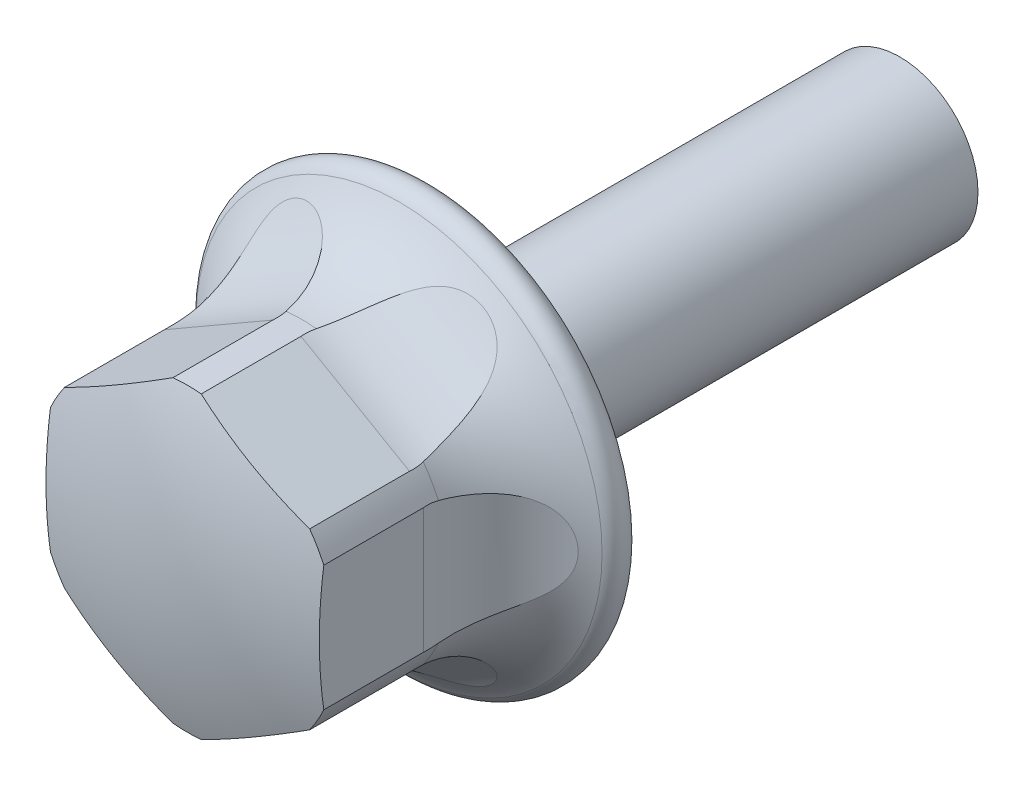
ISO-10303-21;
HEADER;
FILE_DESCRIPTION(('STEP AP214'),'2;1');
FILE_NAME('part.step','',(''),(''),'','','');
FILE_SCHEMA(('AUTOMOTIVE_DESIGN { 1 0 10303 214 1 1 1 1 }'));
ENDSEC;
DATA;
#1=APPLICATION_CONTEXT('core data for automotive mechanical design processes');
#2=APPLICATION_PROTOCOL_DEFINITION('international standard','automotive_design',2000,#1);
#3=PRODUCT_CONTEXT('',#1,'mechanical');
#4=PRODUCT('Part','Part','',(#3));
#5=PRODUCT_RELATED_PRODUCT_CATEGORY('part','',(#4));
#6=PRODUCT_DEFINITION_FORMATION('','',#4);
#7=PRODUCT_DEFINITION_CONTEXT('part definition',#1,'design');
#8=PRODUCT_DEFINITION('design','',#6,#7);
#9=PRODUCT_DEFINITION_SHAPE('','',#8);
#10=(LENGTH_UNIT() NAMED_UNIT(*) SI_UNIT(.MILLI.,.METRE.));
#11=(NAMED_UNIT(*) PLANE_ANGLE_UNIT() SI_UNIT($,.RADIAN.));
#12=(NAMED_UNIT(*) SI_UNIT($,.STERADIAN.) SOLID_ANGLE_UNIT());
#13=UNCERTAINTY_MEASURE_WITH_UNIT(LENGTH_MEASURE(1.E-05),#10,'distance_accuracy_value','');
#14=(GEOMETRIC_REPRESENTATION_CONTEXT(3) GLOBAL_UNCERTAINTY_ASSIGNED_CONTEXT((#13)) GLOBAL_UNIT_ASSIGNED_CONTEXT((#10,
#11,#12)) REPRESENTATION_CONTEXT('',''));
#15=CARTESIAN_POINT('',(0.,0.,0.));
#16=DIRECTION('',(0.,0.,1.));
#17=DIRECTION('',(1.,0.,0.));
#18=AXIS2_PLACEMENT_3D('',#15,#16,#17);
#19=CARTESIAN_POINT('',(0.,0.,0.));
#20=DIRECTION('',(0.,0.,1.));
#21=DIRECTION('',(1.,0.,0.));
#22=AXIS2_PLACEMENT_3D('',#19,#20,#21);
#23=CYLINDRICAL_SURFACE('',#22,3.85);
#24=DIRECTION('',(0.,0.,1.));
#25=VECTOR('',#24,1.);
#26=CARTESIAN_POINT('',(0.360980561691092,3.8330396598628,0.));
#27=LINE('',#26,#25);
#28=CARTESIAN_POINT('',(0.360980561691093,3.8330396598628,3.7));
#29=VERTEX_POINT('',#28);
#30=CARTESIAN_POINT('',(0.360980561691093,3.8330396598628,6.25454860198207));
#31=VERTEX_POINT('',#30);
#32=EDGE_CURVE('E285',#29,#31,#27,.T.);
#33=ORIENTED_EDGE('',*,*,#32,.F.);
#34=CARTESIAN_POINT('',(3.14133213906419,2.22587789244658,3.6));
#35=CARTESIAN_POINT('',(3.14132972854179,2.22588680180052,3.67209261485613));
#36=CARTESIAN_POINT('',(3.13772805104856,2.23099205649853,3.74427829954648));
#37=CARTESIAN_POINT('',(3.12329618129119,2.25114755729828,3.8866251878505));
#38=CARTESIAN_POINT('',(3.11244895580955,2.26622123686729,3.95678121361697));
#39=CARTESIAN_POINT('',(3.0835648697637,2.30536630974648,4.09278988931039));
#40=CARTESIAN_POINT('',(3.06554520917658,2.3294161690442,4.15865239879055));
#41=CARTESIAN_POINT('',(3.02242675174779,2.38509307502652,4.28453173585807));
#42=CARTESIAN_POINT('',(2.99733125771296,2.4167165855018,4.344551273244));
#43=CARTESIAN_POINT('',(2.93955899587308,2.48668377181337,4.45899291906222));
#44=CARTESIAN_POINT('',(2.90670406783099,2.52517918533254,4.51323167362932));
#45=CARTESIAN_POINT('',(2.834218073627,2.60627411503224,4.61347454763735));
#46=CARTESIAN_POINT('',(2.79458433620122,2.64887524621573,4.65947540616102));
#47=CARTESIAN_POINT('',(2.70521902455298,2.74020561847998,4.74668734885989));
#48=CARTESIAN_POINT('',(2.65489561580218,2.7891390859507,4.78707640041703));
#49=CARTESIAN_POINT('',(2.5477903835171,2.88730860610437,4.85760178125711));
#50=CARTESIAN_POINT('',(2.49100544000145,2.93654479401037,4.88773312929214));
#51=CARTESIAN_POINT('',(2.36485016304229,3.03930226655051,4.94098195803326));
#52=CARTESIAN_POINT('',(2.29478688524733,3.09263171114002,4.96282947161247));
#53=CARTESIAN_POINT('',(2.14930325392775,3.19545725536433,4.994345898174));
#54=CARTESIAN_POINT('',(2.07388008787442,3.2449513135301,5.0040083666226));
#55=CARTESIAN_POINT('',(1.91182641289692,3.34323636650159,5.01171324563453));
#56=CARTESIAN_POINT('',(1.82481601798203,3.39150087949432,5.00854732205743));
#57=CARTESIAN_POINT('',(1.64867265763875,3.48053494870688,4.98772705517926));
#58=CARTESIAN_POINT('',(1.55953898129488,3.52130195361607,4.97006779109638));
#59=CARTESIAN_POINT('',(1.3806473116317,3.59524964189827,4.9194149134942));
#60=CARTESIAN_POINT('',(1.29090203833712,3.62829894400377,4.88618119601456));
#61=CARTESIAN_POINT('',(1.11607614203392,3.68582821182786,4.80375685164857));
#62=CARTESIAN_POINT('',(1.03099276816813,3.71031327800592,4.75457575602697));
#63=CARTESIAN_POINT('',(0.876776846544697,3.74961025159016,4.64496546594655));
#64=CARTESIAN_POINT('',(0.806906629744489,3.76505601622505,4.58580750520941));
#65=CARTESIAN_POINT('',(0.678931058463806,3.7902259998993,4.45487866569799));
#66=CARTESIAN_POINT('',(0.620813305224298,3.79995626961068,4.38312123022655));
#67=CARTESIAN_POINT('',(0.526577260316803,3.81407903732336,4.23906105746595));
#68=CARTESIAN_POINT('',(0.488584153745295,3.81899981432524,4.16803379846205));
#69=CARTESIAN_POINT('',(0.426275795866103,3.82645839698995,4.02009144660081));
#70=CARTESIAN_POINT('',(0.401953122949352,3.8289974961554,3.94317957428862));
#71=CARTESIAN_POINT('',(0.369819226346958,3.83222761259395,3.79338854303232));
#72=CARTESIAN_POINT('',(0.36069113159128,3.83306758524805,3.72079246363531));
#73=CARTESIAN_POINT('',(0.355138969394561,3.83358665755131,3.57511986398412));
#74=CARTESIAN_POINT('',(0.358711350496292,3.83326608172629,3.50204348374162));
#75=CARTESIAN_POINT('',(0.378082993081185,3.83140185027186,3.35993726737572));
#76=CARTESIAN_POINT('',(0.393488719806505,3.82989752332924,3.29085270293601));
#77=CARTESIAN_POINT('',(0.43541385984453,3.82535691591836,3.15620987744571));
#78=CARTESIAN_POINT('',(0.461932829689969,3.82232069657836,3.09065147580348));
#79=CARTESIAN_POINT('',(0.525482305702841,3.8141059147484,2.9637516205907));
#80=CARTESIAN_POINT('',(0.562666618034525,3.80889545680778,2.90248951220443));
#81=CARTESIAN_POINT('',(0.645851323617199,3.79567451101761,2.78663451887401));
#82=CARTESIAN_POINT('',(0.691853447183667,3.78766347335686,2.73204294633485));
#83=CARTESIAN_POINT('',(0.793941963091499,3.76762742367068,2.62730956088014));
#84=CARTESIAN_POINT('',(0.850472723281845,3.75538709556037,2.57764331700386));
#85=CARTESIAN_POINT('',(0.969298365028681,3.72648654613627,2.48733296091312));
#86=CARTESIAN_POINT('',(1.03159558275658,3.70982452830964,2.44669252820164));
#87=CARTESIAN_POINT('',(1.16665056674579,3.66972569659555,2.37073273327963));
#88=CARTESIAN_POINT('',(1.23981909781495,3.64576027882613,2.33642416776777));
#89=CARTESIAN_POINT('',(1.38823431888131,3.59187298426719,2.27873434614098));
#90=CARTESIAN_POINT('',(1.46348205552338,3.56194805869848,2.25535870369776));
#91=CARTESIAN_POINT('',(1.62292979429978,3.49242319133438,2.21708076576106));
#92=CARTESIAN_POINT('',(1.70713440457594,3.45209709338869,2.2035101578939));
#93=CARTESIAN_POINT('',(1.87322046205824,3.36487137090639,2.18933908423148));
#94=CARTESIAN_POINT('',(1.95510068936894,3.31796836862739,2.18874530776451));
#95=CARTESIAN_POINT('',(2.1203235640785,3.21509841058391,2.20095385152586));
#96=CARTESIAN_POINT('',(2.2033417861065,3.15872083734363,2.21473059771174));
#97=CARTESIAN_POINT('',(2.36220399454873,3.04174621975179,2.25758442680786));
#98=CARTESIAN_POINT('',(2.43804730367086,2.9811487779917,2.28666295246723));
#99=CARTESIAN_POINT('',(2.57902416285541,2.85999818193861,2.3599068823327));
#100=CARTESIAN_POINT('',(2.64434850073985,2.79947059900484,2.40374408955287));
#101=CARTESIAN_POINT('',(2.76433887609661,2.68104952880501,2.50686671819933));
#102=CARTESIAN_POINT('',(2.81901589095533,2.62315337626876,2.56613608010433));
#103=CARTESIAN_POINT('',(2.9109311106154,2.52055788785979,2.69208328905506));
#104=CARTESIAN_POINT('',(2.94942597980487,2.47510744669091,2.75722909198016));
#105=CARTESIAN_POINT('',(3.01615970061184,2.39334071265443,2.89778338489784));
#106=CARTESIAN_POINT('',(3.0444018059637,2.35702152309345,2.97318860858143));
#107=CARTESIAN_POINT('',(3.08744702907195,2.30027918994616,3.12193102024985));
#108=CARTESIAN_POINT('',(3.10347518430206,2.27845103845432,3.19438350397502));
#109=CARTESIAN_POINT('',(3.12728289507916,2.24566806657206,3.3428671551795));
#110=CARTESIAN_POINT('',(3.13508644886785,2.23468161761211,3.41888723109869));
#111=CARTESIAN_POINT('',(3.14049004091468,2.22706492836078,3.53018309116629));
#112=CARTESIAN_POINT('',(3.14133330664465,2.2258735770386,3.56508062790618));
#113=CARTESIAN_POINT('',(3.14133213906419,2.22587789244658,3.6));
#114=B_SPLINE_CURVE_WITH_KNOTS('',3,(#34,#35,#36,#37,#38,#39,#40,#41,#42,#43,#44,#45,#46,#47,
#48,#49,#50,#51,#52,#53,#54,#55,#56,#57,#58,#59,#60,#61,#62,#63,#64,#65,#66,#67,#68,#69,#70,#71,
#72,#73,#74,#75,#76,#77,#78,#79,#80,#81,#82,#83,#84,#85,#86,#87,#88,#89,#90,#91,#92,#93,#94,#95,
#96,#97,#98,#99,#100,#101,#102,#103,#104,#105,#106,#107,#108,#109,#110,#111,#112,#113),
.UNSPECIFIED.,.T.,.F.,(4,2,2,2,2,2,2,2,2,2,2,2,2,2,2,2,2,2,2,2,2,2,2,2,2,2,2,2,2,2,2,2,2,2,2,2,
2,2,2,4),(0.,0.216172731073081,0.432855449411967,0.64902164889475,0.865087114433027,
1.08670191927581,1.3084042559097,1.55036947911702,1.79245203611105,2.06348945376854,
2.33467016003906,2.63195985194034,2.92935052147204,3.23148484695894,3.5334389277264,
3.81034897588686,4.08696534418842,4.32773862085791,4.56838105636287,4.78681066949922,
5.00517920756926,5.21658420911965,5.42798077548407,5.64259400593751,5.85724939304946,
6.08501804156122,6.3128793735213,6.56473225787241,6.81671431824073,7.09854455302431,
7.38052006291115,7.68294063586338,7.9853897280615,8.28151430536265,8.57733194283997,
8.84061034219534,9.10380511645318,9.33465462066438,9.56482865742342,9.66953586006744),.UNSPECIFIED.);
#115=CARTESIAN_POINT('',(0.38626604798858,3.83057417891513,3.33));
#116=VERTEX_POINT('',#115);
#117=EDGE_CURVE('E628',#29,#116,#114,.T.);
#118=ORIENTED_EDGE('',*,*,#117,.T.);
#119=CARTESIAN_POINT('',(0.,0.,3.33));
#120=DIRECTION('',(0.,0.,1.));
#121=DIRECTION('',(1.,0.,0.));
#122=AXIS2_PLACEMENT_3D('',#119,#120,#121);
#123=CIRCLE('',#122,3.85);
#124=CARTESIAN_POINT('',(-0.386266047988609,3.83057417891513,3.33));
#125=VERTEX_POINT('',#124);
#126=EDGE_CURVE('E267',#116,#125,#123,.T.);
#127=ORIENTED_EDGE('',*,*,#126,.T.);
#128=CARTESIAN_POINT('',(-0.357000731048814,3.83341238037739,3.6));
#129=CARTESIAN_POINT('',(-0.357009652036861,3.83341474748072,3.67209261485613));
#130=CARTESIAN_POINT('',(-0.36323177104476,3.83284823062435,3.74427829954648));
#131=CARTESIAN_POINT('',(-0.387902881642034,3.83042761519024,3.8866251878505));
#132=CARTESIAN_POINT('',(-0.406380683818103,3.82857048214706,3.95678121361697));
#133=CARTESIAN_POINT('',(-0.454723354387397,3.82312866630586,4.09278988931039));
#134=CARTESIAN_POINT('',(-0.484560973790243,3.8195481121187,4.15865239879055));
#135=CARTESIAN_POINT('',(-0.554337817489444,3.81004488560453,4.28453173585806));
#136=CARTESIAN_POINT('',(-0.594272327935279,3.80412330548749,4.34455127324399));
#137=CARTESIAN_POINT('',(-0.683751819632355,3.78907465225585,4.45899291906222));
#138=CARTESIAN_POINT('',(-0.733517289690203,3.77986915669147,4.51323167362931));
#139=CARTESIAN_POINT('',(-0.839990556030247,3.75764190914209,4.61347454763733));
#140=CARTESIAN_POINT('',(-0.896701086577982,3.74461865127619,4.65947540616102));
#141=CARTESIAN_POINT('',(-1.02047816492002,3.71289120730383,4.74668734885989));
#142=CARTESIAN_POINT('',(-1.08801749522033,3.69377659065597,4.78707640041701));
#143=CARTESIAN_POINT('',(-1.22658740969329,3.65010549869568,4.85760178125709));
#144=CARTESIAN_POINT('',(-1.29761967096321,3.62554638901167,4.88773312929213));
#145=CARTESIAN_POINT('',(-1.44968789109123,3.56767145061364,4.94098195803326));
#146=CARTESIAN_POINT('',(-1.53090418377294,3.53365959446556,4.96282947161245));
#147=CARTESIAN_POINT('',(-1.69269553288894,3.45907984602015,4.99434589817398));
#148=CARTESIAN_POINT('',(-1.77327022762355,3.41850849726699,5.0040083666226));
#149=CARTESIAN_POINT('',(-1.9394144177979,3.3273084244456,5.01171324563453));
#150=CARTESIAN_POINT('',(-2.02471790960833,3.27608746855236,5.00854732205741));
#151=CARTESIAN_POINT('',(-2.18989535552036,3.16805987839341,4.98772705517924));
#152=CARTESIAN_POINT('',(-2.26976745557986,3.1112513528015,4.97006779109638));
#153=CARTESIAN_POINT('',(-2.42325386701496,2.99330046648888,4.9194149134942));
#154=CARTESIAN_POINT('',(-2.49674803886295,2.93210343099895,4.88618119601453));
#155=CARTESIAN_POINT('',(-2.63398279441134,2.80946439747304,4.80375685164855));
#156=CARTESIAN_POINT('',(-2.69772917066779,2.7480225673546,4.75457575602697));
#157=CARTESIAN_POINT('',(-2.80886930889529,2.6341161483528,4.64496546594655));
#158=CARTESIAN_POINT('',(-2.85718084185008,2.58132964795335,4.5858075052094));
#159=CARTESIAN_POINT('',(-2.94296647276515,2.48308454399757,4.45487866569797));
#160=CARTESIAN_POINT('',(-2.98045201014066,2.43761822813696,4.38312123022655));
#161=CARTESIAN_POINT('',(-3.03980070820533,2.36306880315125,4.23906105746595));
#162=CARTESIAN_POINT('',(-3.06305877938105,2.33262619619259,4.16803379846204));
#163=CARTESIAN_POINT('',(-3.10067228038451,2.28239486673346,4.0200914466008));
#164=CARTESIAN_POINT('',(-3.11503254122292,2.26260036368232,3.94317957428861));
#165=CARTESIAN_POINT('',(-3.13389685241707,2.23638665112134,3.79338854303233));
#166=CARTESIAN_POINT('',(-3.13918833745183,2.22890147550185,3.72079246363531));
#167=CARTESIAN_POINT('',(-3.14241394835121,2.22435269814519,3.57511986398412));
#168=CARTESIAN_POINT('',(-3.14035013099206,2.22728618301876,3.50204348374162));
#169=CARTESIAN_POINT('',(-3.12904983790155,2.24313040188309,3.35993726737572));
#170=CARTESIAN_POINT('',(-3.12004418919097,2.25571998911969,3.29085270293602));
#171=CARTESIAN_POINT('',(-3.09514933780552,2.2897579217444,3.15620987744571));
#172=CARTESIAN_POINT('',(-3.0792604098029,2.31120591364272,3.09065147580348));
#173=CARTESIAN_POINT('',(-3.04037146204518,2.36213398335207,2.9637516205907));
#174=CARTESIAN_POINT('',(-3.0172669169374,2.39173131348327,2.90248951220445));
#175=CARTESIAN_POINT('',(-2.96422488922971,2.45716090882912,2.78663451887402));
#176=CARTESIAN_POINT('',(-2.93428606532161,2.49299439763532,2.73204294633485));
#177=CARTESIAN_POINT('',(-2.86589007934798,2.57138762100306,2.62730956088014));
#178=CARTESIAN_POINT('',(-2.82702426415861,2.614224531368,2.57764331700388));
#179=CARTESIAN_POINT('',(-2.7425828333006,2.7026802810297,2.48733296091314));
#180=CARTESIAN_POINT('',(-2.69700449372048,2.74830024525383,2.44669252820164));
#181=CARTESIAN_POINT('',(-2.5947503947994,2.84521187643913,2.37073273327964));
#182=CARTESIAN_POINT('',(-2.5374114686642,2.89659497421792,2.33642416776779));
#183=CARTESIAN_POINT('',(-2.41653609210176,2.99818267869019,2.278734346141));
#184=CARTESIAN_POINT('',(-2.35299647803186,3.04838666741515,2.25535870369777));
#185=CARTESIAN_POINT('',(-2.21306230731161,3.15171002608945,2.21708076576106));
#186=CARTESIAN_POINT('',(-2.13603657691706,3.20447030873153,2.20351015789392));
#187=CARTESIAN_POINT('',(-1.9774538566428,3.30469219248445,2.1893390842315));
#188=CARTESIAN_POINT('',(-1.89589455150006,3.35215104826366,2.18874530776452));
#189=CARTESIAN_POINT('',(-1.7241951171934,3.44380327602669,2.20095385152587));
#190=CARTESIAN_POINT('',(-1.6338615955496,3.48751037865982,2.21473059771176));
#191=CARTESIAN_POINT('',(-1.45312750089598,3.56660177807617,2.25758442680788));
#192=CARTESIAN_POINT('',(-1.36272692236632,3.60198528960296,2.28666295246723));
#193=CARTESIAN_POINT('',(-1.18731899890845,3.66349953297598,2.3599068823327));
#194=CARTESIAN_POINT('',(-1.10223840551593,3.68980827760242,2.40374408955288));
#195=CARTESIAN_POINT('',(-0.939687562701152,3.73451245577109,2.50686671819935));
#196=CARTESIAN_POINT('',(-0.862209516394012,3.75291606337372,2.56613608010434));
#197=CARTESIAN_POINT('',(-0.727401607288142,3.78121923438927,2.69208328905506));
#198=CARTESIAN_POINT('',(-0.668792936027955,3.79183154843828,2.75722909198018));
#199=CARTESIAN_POINT('',(-0.56461400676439,3.80874127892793,2.89778338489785));
#200=CARTESIAN_POINT('',(-0.519039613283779,3.81504006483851,2.97318860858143));
#201=CARTESIAN_POINT('',(-0.448376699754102,3.82394715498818,3.12193102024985));
#202=CARTESIAN_POINT('',(-0.421458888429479,3.82691386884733,3.19438350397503));
#203=CARTESIAN_POINT('',(-0.381164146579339,3.83114046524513,3.34286715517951));
#204=CARTESIAN_POINT('',(-0.367747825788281,3.83240531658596,3.41888723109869));
#205=CARTESIAN_POINT('',(-0.35844978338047,3.83327661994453,3.53018309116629));
#206=CARTESIAN_POINT('',(-0.356996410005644,3.83341123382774,3.56508062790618));
#207=CARTESIAN_POINT('',(-0.357000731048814,3.83341238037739,3.6));
#208=B_SPLINE_CURVE_WITH_KNOTS('',3,(#128,#129,#130,#131,#132,#133,#134,#135,#136,#137,#138,
#139,#140,#141,#142,#143,#144,#145,#146,#147,#148,#149,#150,#151,#152,#153,#154,#155,#156,#157,
#158,#159,#160,#161,#162,#163,#164,#165,#166,#167,#168,#169,#170,#171,#172,#173,#174,#175,#176,
#177,#178,#179,#180,#181,#182,#183,#184,#185,#186,#187,#188,#189,#190,#191,#192,#193,#194,#195,
#196,#197,#198,#199,#200,#201,#202,#203,#204,#205,#206,#207),.UNSPECIFIED.,.T.,.F.,(4,2,2,2,2,2,
2,2,2,2,2,2,2,2,2,2,2,2,2,2,2,2,2,2,2,2,2,2,2,2,2,2,2,2,2,2,2,2,2,4),(0.,0.21617273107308,
0.432855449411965,0.649021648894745,0.865087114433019,1.0867019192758,1.30840425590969,
1.550369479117,1.79245203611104,2.06348945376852,2.33467016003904,2.63195985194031,
2.92935052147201,3.23148484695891,3.53343892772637,3.81034897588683,4.08696534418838,
4.32773862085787,4.56838105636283,4.78681066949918,5.00517920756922,5.2165842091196,
5.42798077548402,5.64259400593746,5.8572493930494,6.08501804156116,6.31287937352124,
6.56473225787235,6.81671431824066,7.09854455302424,7.38052006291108,7.68294063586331,
7.98538972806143,8.28151430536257,8.57733194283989,8.84061034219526,9.10380511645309,
9.33465462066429,9.56482865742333,9.66953586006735),.UNSPECIFIED.);
#209=CARTESIAN_POINT('',(-0.360980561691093,3.83303965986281,3.7));
#210=VERTEX_POINT('',#209);
#211=EDGE_CURVE('E607',#125,#210,#208,.T.);
#212=ORIENTED_EDGE('',*,*,#211,.T.);
#213=DIRECTION('',(0.,0.,1.));
#214=VECTOR('',#213,1.);
#215=CARTESIAN_POINT('',(-0.360980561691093,3.8330396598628,0.));
#216=LINE('',#215,#214);
#217=CARTESIAN_POINT('',(-0.360980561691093,3.83303965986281,6.25454860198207));
#218=VERTEX_POINT('',#217);
#219=EDGE_CURVE('E288',#218,#210,#216,.F.);
#220=ORIENTED_EDGE('',*,*,#219,.F.);
#221=CARTESIAN_POINT('',(0.,0.,6.25454860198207));
#222=DIRECTION('',(0.,0.,1.));
#223=DIRECTION('',(1.,0.,0.));
#224=AXIS2_PLACEMENT_3D('',#221,#222,#223);
#225=CIRCLE('',#224,3.85);
#226=EDGE_CURVE('E281',#31,#218,#225,.T.);
#227=ORIENTED_EDGE('',*,*,#226,.F.);
#228=EDGE_LOOP('',(#33,#118,#127,#212,#220,#227));
#229=FACE_BOUND('',#228,.T.);
#230=ADVANCED_FACE('F16',(#229),#23,.T.);
#231=DIRECTION('',(0.,0.,1.));
#232=VECTOR('',#231,1.);
#233=CARTESIAN_POINT('',(3.13901943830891,-2.22913816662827,0.));
#234=LINE('',#233,#232);
#235=CARTESIAN_POINT('',(3.13901943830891,-2.22913816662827,3.7));
#236=VERTEX_POINT('',#235);
#237=CARTESIAN_POINT('',(3.13901943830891,-2.22913816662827,6.25454860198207));
#238=VERTEX_POINT('',#237);
#239=EDGE_CURVE('E172',#236,#238,#234,.T.);
#240=ORIENTED_EDGE('',*,*,#239,.F.);
#241=CARTESIAN_POINT('',(0.357000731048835,-3.83341238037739,3.6));
#242=CARTESIAN_POINT('',(0.357009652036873,-3.83341474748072,3.67209261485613));
#243=CARTESIAN_POINT('',(0.363231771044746,-3.83284823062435,3.74427829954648));
#244=CARTESIAN_POINT('',(0.387902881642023,-3.83042761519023,3.8866251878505));
#245=CARTESIAN_POINT('',(0.406380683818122,-3.82857048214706,3.95678121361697));
#246=CARTESIAN_POINT('',(0.454723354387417,-3.82312866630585,4.09278988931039));
#247=CARTESIAN_POINT('',(0.484560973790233,-3.8195481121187,4.15865239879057));
#248=CARTESIAN_POINT('',(0.554337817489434,-3.81004488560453,4.28453173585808));
#249=CARTESIAN_POINT('',(0.594272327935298,-3.80412330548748,4.34455127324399));
#250=CARTESIAN_POINT('',(0.68375181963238,-3.78907465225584,4.45899291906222));
#251=CARTESIAN_POINT('',(0.733517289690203,-3.77986915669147,4.51323167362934));
#252=CARTESIAN_POINT('',(0.839990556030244,-3.75764190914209,4.61347454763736));
#253=CARTESIAN_POINT('',(0.896701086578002,-3.74461865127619,4.65947540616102));
#254=CARTESIAN_POINT('',(1.02047816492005,-3.71289120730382,4.74668734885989));
#255=CARTESIAN_POINT('',(1.08801749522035,-3.69377659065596,4.78707640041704));
#256=CARTESIAN_POINT('',(1.22658740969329,-3.65010549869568,4.85760178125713));
#257=CARTESIAN_POINT('',(1.29761967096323,-3.62554638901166,4.88773312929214));
#258=CARTESIAN_POINT('',(1.44968789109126,-3.56767145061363,4.94098195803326));
#259=CARTESIAN_POINT('',(1.53090418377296,-3.53365959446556,4.96282947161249));
#260=CARTESIAN_POINT('',(1.69269553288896,-3.45907984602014,4.99434589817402));
#261=CARTESIAN_POINT('',(1.77327022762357,-3.41850849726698,5.0040083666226));
#262=CARTESIAN_POINT('',(1.93941441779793,-3.32730842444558,5.01171324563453));
#263=CARTESIAN_POINT('',(2.02471790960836,-3.27608746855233,5.00854732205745));
#264=CARTESIAN_POINT('',(2.18989535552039,-3.16805987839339,4.98772705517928));
#265=CARTESIAN_POINT('',(2.26976745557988,-3.11125135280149,4.97006779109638));
#266=CARTESIAN_POINT('',(2.42325386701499,-2.99330046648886,4.9194149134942));
#267=CARTESIAN_POINT('',(2.496748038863,-2.93210343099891,4.88618119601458));
#268=CARTESIAN_POINT('',(2.63398279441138,-2.809464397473,4.80375685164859));
#269=CARTESIAN_POINT('',(2.6977291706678,-2.74802256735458,4.75457575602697));
#270=CARTESIAN_POINT('',(2.80886930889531,-2.63411614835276,4.64496546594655));
#271=CARTESIAN_POINT('',(2.85718084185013,-2.58132964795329,4.58580750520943));
#272=CARTESIAN_POINT('',(2.9429664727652,-2.48308454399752,4.45487866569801));
#273=CARTESIAN_POINT('',(2.98045201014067,-2.43761822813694,4.38312123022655));
#274=CARTESIAN_POINT('',(3.03980070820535,-2.36306880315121,4.23906105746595));
#275=CARTESIAN_POINT('',(3.06305877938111,-2.33262619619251,4.16803379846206));
#276=CARTESIAN_POINT('',(3.10067228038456,-2.2823948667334,4.02009144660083));
#277=CARTESIAN_POINT('',(3.11503254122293,-2.2626003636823,3.94317957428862));
#278=CARTESIAN_POINT('',(3.13389685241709,-2.23638665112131,3.79338854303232));
#279=CARTESIAN_POINT('',(3.13918833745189,-2.22890147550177,3.72079246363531));
#280=CARTESIAN_POINT('',(3.14241394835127,-2.22435269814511,3.57511986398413));
#281=CARTESIAN_POINT('',(3.14035013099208,-2.22728618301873,3.50204348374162));
#282=CARTESIAN_POINT('',(3.12904983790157,-2.24313040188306,3.35993726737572));
#283=CARTESIAN_POINT('',(3.12004418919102,-2.25571998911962,3.290852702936));
#284=CARTESIAN_POINT('',(3.09514933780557,-2.28975792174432,3.1562098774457));
#285=CARTESIAN_POINT('',(3.07926040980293,-2.31120591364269,3.09065147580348));
#286=CARTESIAN_POINT('',(3.0403714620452,-2.36213398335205,2.9637516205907));
#287=CARTESIAN_POINT('',(3.01726691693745,-2.39173131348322,2.90248951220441));
#288=CARTESIAN_POINT('',(2.96422488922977,-2.45716090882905,2.78663451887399));
#289=CARTESIAN_POINT('',(2.93428606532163,-2.49299439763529,2.73204294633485));
#290=CARTESIAN_POINT('',(2.86589007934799,-2.57138762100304,2.62730956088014));
#291=CARTESIAN_POINT('',(2.82702426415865,-2.61422453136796,2.57764331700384));
#292=CARTESIAN_POINT('',(2.74258283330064,-2.70268028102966,2.4873329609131));
#293=CARTESIAN_POINT('',(2.69700449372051,-2.7483002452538,2.44669252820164));
#294=CARTESIAN_POINT('',(2.59475039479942,-2.84521187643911,2.37073273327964));
#295=CARTESIAN_POINT('',(2.53741146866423,-2.89659497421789,2.33642416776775));
#296=CARTESIAN_POINT('',(2.41653609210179,-2.99818267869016,2.27873434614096));
#297=CARTESIAN_POINT('',(2.35299647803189,-3.04838666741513,2.25535870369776));
#298=CARTESIAN_POINT('',(2.21306230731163,-3.15171002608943,2.21708076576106));
#299=CARTESIAN_POINT('',(2.13603657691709,-3.20447030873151,2.20351015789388));
#300=CARTESIAN_POINT('',(1.97745385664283,-3.30469219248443,2.18933908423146));
#301=CARTESIAN_POINT('',(1.89589455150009,-3.35215104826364,2.18874530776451));
#302=CARTESIAN_POINT('',(1.72419511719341,-3.44380327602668,2.20095385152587));
#303=CARTESIAN_POINT('',(1.63386159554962,-3.48751037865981,2.21473059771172));
#304=CARTESIAN_POINT('',(1.45312750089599,-3.56660177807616,2.25758442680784));
#305=CARTESIAN_POINT('',(1.36272692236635,-3.60198528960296,2.28666295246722));
#306=CARTESIAN_POINT('',(1.18731899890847,-3.66349953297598,2.35990688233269));
#307=CARTESIAN_POINT('',(1.10223840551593,-3.68980827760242,2.40374408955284));
#308=CARTESIAN_POINT('',(0.93968756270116,-3.73451245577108,2.50686671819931));
#309=CARTESIAN_POINT('',(0.862209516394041,-3.75291606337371,2.56613608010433));
#310=CARTESIAN_POINT('',(0.727401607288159,-3.78121923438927,2.69208328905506));
#311=CARTESIAN_POINT('',(0.668792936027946,-3.79183154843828,2.75722909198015));
#312=CARTESIAN_POINT('',(0.564614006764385,-3.80874127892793,2.89778338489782));
#313=CARTESIAN_POINT('',(0.519039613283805,-3.8150400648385,2.97318860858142));
#314=CARTESIAN_POINT('',(0.448376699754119,-3.82394715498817,3.12193102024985));
#315=CARTESIAN_POINT('',(0.421458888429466,-3.82691386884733,3.19438350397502));
#316=CARTESIAN_POINT('',(0.381164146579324,-3.83114046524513,3.34286715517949));
#317=CARTESIAN_POINT('',(0.367747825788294,-3.83240531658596,3.41888723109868));
#318=CARTESIAN_POINT('',(0.358449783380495,-3.83327661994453,3.53018309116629));
#319=CARTESIAN_POINT('',(0.356996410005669,-3.83341123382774,3.56508062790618));
#320=CARTESIAN_POINT('',(0.357000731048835,-3.83341238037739,3.6));
#321=B_SPLINE_CURVE_WITH_KNOTS('',3,(#241,#242,#243,#244,#245,#246,#247,#248,#249,#250,#251,
#252,#253,#254,#255,#256,#257,#258,#259,#260,#261,#262,#263,#264,#265,#266,#267,#268,#269,#270,
#271,#272,#273,#274,#275,#276,#277,#278,#279,#280,#281,#282,#283,#284,#285,#286,#287,#288,#289,
#290,#291,#292,#293,#294,#295,#296,#297,#298,#299,#300,#301,#302,#303,#304,#305,#306,#307,#308,
#309,#310,#311,#312,#313,#314,#315,#316,#317,#318,#319,#320),.UNSPECIFIED.,.T.,.F.,(4,2,2,2,2,2,
2,2,2,2,2,2,2,2,2,2,2,2,2,2,2,2,2,2,2,2,2,2,2,2,2,2,2,2,2,2,2,2,2,4),(0.,0.216172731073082,
0.432855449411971,0.649021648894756,0.865087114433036,1.08670191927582,1.30840425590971,
1.55036947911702,1.79245203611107,2.06348945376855,2.33467016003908,2.63195985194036,
2.92935052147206,3.23148484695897,3.53343892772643,3.81034897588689,4.08696534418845,
4.32773862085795,4.56838105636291,4.78681066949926,5.00517920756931,5.2165842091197,
5.42798077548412,5.64259400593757,5.85724939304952,6.08501804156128,6.31287937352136,
6.56473225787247,6.81671431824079,7.09854455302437,7.38052006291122,7.68294063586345,
7.98538972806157,8.28151430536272,8.57733194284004,8.84061034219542,9.10380511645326,
9.33465462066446,9.5648286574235,9.66953586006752),.UNSPECIFIED.);
#322=CARTESIAN_POINT('',(3.12424152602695,-2.24980329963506,3.33));
#323=VERTEX_POINT('',#322);
#324=EDGE_CURVE('E147',#236,#323,#321,.T.);
#325=ORIENTED_EDGE('',*,*,#324,.T.);
#326=CARTESIAN_POINT('',(3.51050757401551,-1.58077087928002,3.33));
#327=VERTEX_POINT('',#326);
#328=EDGE_CURVE('E269',#323,#327,#123,.T.);
#329=ORIENTED_EDGE('',*,*,#328,.T.);
#330=CARTESIAN_POINT('',(3.51050757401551,-1.58077087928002,3.33));
#331=CARTESIAN_POINT('',(3.50736845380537,-1.58773583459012,3.36470736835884));
#332=CARTESIAN_POINT('',(3.50481753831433,-1.59335256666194,3.39972194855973));
#333=CARTESIAN_POINT('',(3.50093735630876,-1.60186234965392,3.47014589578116));
#334=CARTESIAN_POINT('',(3.4996080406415,-1.6047555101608,3.50555524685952));
#335=CARTESIAN_POINT('',(3.49752355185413,-1.60930179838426,3.61187097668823));
#336=CARTESIAN_POINT('',(3.4986555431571,-1.60685714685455,3.68304252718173));
#337=CARTESIAN_POINT('',(3.50586673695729,-1.59105899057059,3.82390497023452));
#338=CARTESIAN_POINT('',(3.51194853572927,-1.57769976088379,3.8935950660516));
#339=CARTESIAN_POINT('',(3.52845398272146,-1.54042986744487,4.02954284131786));
#340=CARTESIAN_POINT('',(3.53887711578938,-1.51652045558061,4.09580092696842));
#341=CARTESIAN_POINT('',(3.56315059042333,-1.45857658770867,4.2236823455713));
#342=CARTESIAN_POINT('',(3.57702732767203,-1.42446372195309,4.28526497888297));
#343=CARTESIAN_POINT('',(3.60685553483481,-1.34714718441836,4.40186488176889));
#344=CARTESIAN_POINT('',(3.62280767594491,-1.30394056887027,4.45688001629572));
#345=CARTESIAN_POINT('',(3.65634404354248,-1.20682786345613,4.56247270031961));
#346=CARTESIAN_POINT('',(3.67396889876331,-1.15243799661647,4.61259120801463));
#347=CARTESIAN_POINT('',(3.70837735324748,-1.03638904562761,4.70387204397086));
#348=CARTESIAN_POINT('',(3.72516066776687,-0.974727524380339,4.74503135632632));
#349=CARTESIAN_POINT('',(3.75817967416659,-0.839015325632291,4.82208960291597));
#350=CARTESIAN_POINT('',(3.77417647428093,-0.764343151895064,4.85699487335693));
#351=CARTESIAN_POINT('',(3.80215781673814,-0.610123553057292,4.91594254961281));
#352=CARTESIAN_POINT('',(3.81414021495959,-0.530573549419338,4.93997915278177));
#353=CARTESIAN_POINT('',(3.83432995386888,-0.358805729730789,4.97972898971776));
#354=CARTESIAN_POINT('',(3.84191909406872,-0.266206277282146,4.99411287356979));
#355=CARTESIAN_POINT('',(3.85031250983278,-0.0795869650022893,5.00998742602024));
#356=CARTESIAN_POINT('',(3.85111328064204,0.0144336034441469,5.01147143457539));
#357=CARTESIAN_POINT('',(3.84565718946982,0.208662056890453,5.00119839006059));
#358=CARTESIAN_POINT('',(3.83886611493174,0.308804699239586,4.98843918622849));
#359=CARTESIAN_POINT('',(3.81798689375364,0.505198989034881,4.94768946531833));
#360=CARTESIAN_POINT('',(3.80389807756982,0.60145027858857,4.91969755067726));
#361=CARTESIAN_POINT('',(3.77021282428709,0.785217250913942,4.84855081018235));
#362=CARTESIAN_POINT('',(3.75071701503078,0.872856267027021,4.80566971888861));
#363=CARTESIAN_POINT('',(3.70846633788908,1.03779381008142,4.70437115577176));
#364=CARTESIAN_POINT('',(3.68571418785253,1.11510085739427,4.64596660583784));
#365=CARTESIAN_POINT('',(3.64264043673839,1.24821797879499,4.52134337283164));
#366=CARTESIAN_POINT('',(3.62232083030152,1.30544628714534,4.45664253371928));
#367=CARTESIAN_POINT('',(3.58432807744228,1.40641866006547,4.31679483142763));
#368=CARTESIAN_POINT('',(3.56665206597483,1.45017737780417,4.24165944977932));
#369=CARTESIAN_POINT('',(3.53832905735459,1.51786316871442,4.09330816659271));
#370=CARTESIAN_POINT('',(3.5270804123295,1.54358277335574,4.02102122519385));
#371=CARTESIAN_POINT('',(3.50980666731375,1.58247228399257,3.87254804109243));
#372=CARTESIAN_POINT('',(3.50377955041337,1.59564703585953,3.79636331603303));
#373=CARTESIAN_POINT('',(3.49812117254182,1.60800549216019,3.65449602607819));
#374=CARTESIAN_POINT('',(3.49764727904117,1.60903269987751,3.58900466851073));
#375=CARTESIAN_POINT('',(3.50012573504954,1.60362722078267,3.49126749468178));
#376=CARTESIAN_POINT('',(3.50148511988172,1.60066401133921,3.45875338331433));
#377=CARTESIAN_POINT('',(3.50523322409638,1.59243762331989,3.39407203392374));
#378=CARTESIAN_POINT('',(3.50762210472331,1.58717408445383,3.36190485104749));
#379=CARTESIAN_POINT('',(3.51050757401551,1.58077087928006,3.33));
#380=B_SPLINE_CURVE_WITH_KNOTS('',3,(#330,#331,#332,#333,#334,#335,#336,#337,#338,#339,#340,
#341,#342,#343,#344,#345,#346,#347,#348,#349,#350,#351,#352,#353,#354,#355,#356,#357,#358,#359,
#360,#361,#362,#363,#364,#365,#366,#367,#368,#369,#370,#371,#372,#373,#374,#375,#376,#377,#378,
#379),.UNSPECIFIED.,.F.,.F.,(4,2,2,2,2,2,2,2,2,2,2,2,2,2,2,2,2,2,2,2,2,2,2,2,4),(0.,
0.106550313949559,0.213096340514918,0.425650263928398,0.638315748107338,0.850956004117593,
1.06527424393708,1.27966196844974,1.50681041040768,1.73403519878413,1.98491446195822,
2.23592750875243,2.51678405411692,2.79778559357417,3.0998773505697,3.40199682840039,
3.69883275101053,3.99542235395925,4.26008655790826,4.52446181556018,4.75587014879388,
4.98718905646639,5.18285377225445,5.2807976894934,5.37875695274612),.UNSPECIFIED.);
#381=CARTESIAN_POINT('',(3.5,-1.60390149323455,3.7));
#382=VERTEX_POINT('',#381);
#383=EDGE_CURVE('E327',#327,#382,#380,.T.);
#384=ORIENTED_EDGE('',*,*,#383,.T.);
#385=DIRECTION('',(0.,0.,1.));
#386=VECTOR('',#385,1.);
#387=CARTESIAN_POINT('',(3.5,-1.60390149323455,0.));
#388=LINE('',#387,#386);
#389=CARTESIAN_POINT('',(3.5,-1.60390149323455,6.25454860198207));
#390=VERTEX_POINT('',#389);
#391=EDGE_CURVE('E179',#390,#382,#388,.F.);
#392=ORIENTED_EDGE('',*,*,#391,.F.);
#393=EDGE_CURVE('E274',#238,#390,#225,.T.);
#394=ORIENTED_EDGE('',*,*,#393,.F.);
#395=EDGE_LOOP('',(#240,#325,#329,#384,#392,#394));
#396=FACE_BOUND('',#395,.T.);
#397=ADVANCED_FACE('F215',(#396),#23,.T.);
#398=CARTESIAN_POINT('',(-0.38626604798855,-3.83057417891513,3.33));
#399=VERTEX_POINT('',#398);
#400=CARTESIAN_POINT('',(0.386266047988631,-3.83057417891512,3.33));
#401=VERTEX_POINT('',#400);
#402=EDGE_CURVE('E164',#399,#401,#123,.T.);
#403=ORIENTED_EDGE('',*,*,#402,.T.);
#404=CARTESIAN_POINT('',(0.360980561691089,-3.83303965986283,3.7));
#405=VERTEX_POINT('',#404);
#406=EDGE_CURVE('E144',#401,#405,#321,.T.);
#407=ORIENTED_EDGE('',*,*,#406,.T.);
#408=DIRECTION('',(0.,0.,1.));
#409=VECTOR('',#408,1.);
#410=CARTESIAN_POINT('',(0.360980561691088,-3.83303965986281,0.));
#411=LINE('',#410,#409);
#412=CARTESIAN_POINT('',(0.360980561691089,-3.8330396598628,6.25454860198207));
#413=VERTEX_POINT('',#412);
#414=EDGE_CURVE('E160',#413,#405,#411,.F.);
#415=ORIENTED_EDGE('',*,*,#414,.F.);
#416=CARTESIAN_POINT('',(-0.360980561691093,-3.83303965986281,6.25454860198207));
#417=VERTEX_POINT('',#416);
#418=EDGE_CURVE('E317',#417,#413,#225,.T.);
#419=ORIENTED_EDGE('',*,*,#418,.F.);
#420=DIRECTION('',(0.,0.,1.));
#421=VECTOR('',#420,1.);
#422=CARTESIAN_POINT('',(-0.360980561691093,-3.8330396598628,0.));
#423=LINE('',#422,#421);
#424=CARTESIAN_POINT('',(-0.360980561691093,-3.83303965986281,3.7));
#425=VERTEX_POINT('',#424);
#426=EDGE_CURVE('E173',#425,#417,#423,.T.);
#427=ORIENTED_EDGE('',*,*,#426,.F.);
#428=CARTESIAN_POINT('',(-3.14133213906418,-2.22587789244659,3.6));
#429=CARTESIAN_POINT('',(-3.14132972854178,-2.22588680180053,3.67209261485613));
#430=CARTESIAN_POINT('',(-3.13772805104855,-2.23099205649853,3.74427829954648));
#431=CARTESIAN_POINT('',(-3.12329618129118,-2.2511475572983,3.8866251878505));
#432=CARTESIAN_POINT('',(-3.11244895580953,-2.26622123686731,3.95678121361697));
#433=CARTESIAN_POINT('',(-3.08356486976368,-2.3053663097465,4.09278988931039));
#434=CARTESIAN_POINT('',(-3.06554520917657,-2.32941616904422,4.15865239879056));
#435=CARTESIAN_POINT('',(-3.02242675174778,-2.38509307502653,4.28453173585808));
#436=CARTESIAN_POINT('',(-2.99733125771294,-2.41671658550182,4.34455127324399));
#437=CARTESIAN_POINT('',(-2.93955899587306,-2.48668377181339,4.45899291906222));
#438=CARTESIAN_POINT('',(-2.90670406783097,-2.52517918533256,4.51323167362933));
#439=CARTESIAN_POINT('',(-2.83421807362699,-2.60627411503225,4.61347454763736));
#440=CARTESIAN_POINT('',(-2.7945843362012,-2.64887524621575,4.65947540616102));
#441=CARTESIAN_POINT('',(-2.70521902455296,-2.74020561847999,4.74668734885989));
#442=CARTESIAN_POINT('',(-2.65489561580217,-2.78913908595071,4.78707640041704));
#443=CARTESIAN_POINT('',(-2.54779038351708,-2.88730860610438,4.85760178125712));
#444=CARTESIAN_POINT('',(-2.49100544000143,-2.93654479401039,4.88773312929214));
#445=CARTESIAN_POINT('',(-2.36485016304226,-3.03930226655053,4.94098195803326));
#446=CARTESIAN_POINT('',(-2.29478688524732,-3.09263171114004,4.96282947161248));
#447=CARTESIAN_POINT('',(-2.14930325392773,-3.19545725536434,4.99434589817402));
#448=CARTESIAN_POINT('',(-2.0738800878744,-3.24495131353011,5.0040083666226));
#449=CARTESIAN_POINT('',(-1.91182641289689,-3.3432363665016,5.01171324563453));
#450=CARTESIAN_POINT('',(-1.824816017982,-3.39150087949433,5.00854732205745));
#451=CARTESIAN_POINT('',(-1.64867265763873,-3.4805349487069,4.98772705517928));
#452=CARTESIAN_POINT('',(-1.55953898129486,-3.52130195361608,4.97006779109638));
#453=CARTESIAN_POINT('',(-1.38064731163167,-3.59524964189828,4.9194149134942));
#454=CARTESIAN_POINT('',(-1.29090203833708,-3.62829894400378,4.88618119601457));
#455=CARTESIAN_POINT('',(-1.11607614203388,-3.68582821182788,4.80375685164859));
#456=CARTESIAN_POINT('',(-1.03099276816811,-3.71031327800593,4.75457575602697));
#457=CARTESIAN_POINT('',(-0.876776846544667,-3.74961025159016,4.64496546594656));
#458=CARTESIAN_POINT('',(-0.806906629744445,-3.76505601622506,4.58580750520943));
#459=CARTESIAN_POINT('',(-0.678931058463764,-3.79022599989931,4.45487866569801));
#460=CARTESIAN_POINT('',(-0.620813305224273,-3.79995626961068,4.38312123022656));
#461=CARTESIAN_POINT('',(-0.526577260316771,-3.81407903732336,4.23906105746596));
#462=CARTESIAN_POINT('',(-0.488584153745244,-3.81899981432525,4.16803379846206));
#463=CARTESIAN_POINT('',(-0.426275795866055,-3.82645839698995,4.02009144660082));
#464=CARTESIAN_POINT('',(-0.401953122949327,-3.8289974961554,3.94317957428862));
#465=CARTESIAN_POINT('',(-0.369819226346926,-3.83222761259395,3.79338854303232));
#466=CARTESIAN_POINT('',(-0.360691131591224,-3.83306758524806,3.72079246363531));
#467=CARTESIAN_POINT('',(-0.355138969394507,-3.83358665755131,3.57511986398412));
#468=CARTESIAN_POINT('',(-0.358711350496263,-3.83326608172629,3.50204348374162));
#469=CARTESIAN_POINT('',(-0.378082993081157,-3.83140185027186,3.35993726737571));
#470=CARTESIAN_POINT('',(-0.393488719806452,-3.82989752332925,3.290852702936));
#471=CARTESIAN_POINT('',(-0.435413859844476,-3.82535691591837,3.1562098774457));
#472=CARTESIAN_POINT('',(-0.461932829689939,-3.82232069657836,3.09065147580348));
#473=CARTESIAN_POINT('',(-0.525482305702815,-3.81410591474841,2.9637516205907));
#474=CARTESIAN_POINT('',(-0.562666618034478,-3.80889545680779,2.90248951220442));
#475=CARTESIAN_POINT('',(-0.64585132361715,-3.79567451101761,2.78663451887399));
#476=CARTESIAN_POINT('',(-0.691853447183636,-3.78766347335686,2.73204294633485));
#477=CARTESIAN_POINT('',(-0.793941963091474,-3.76762742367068,2.62730956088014));
#478=CARTESIAN_POINT('',(-0.850472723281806,-3.75538709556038,2.57764331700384));
#479=CARTESIAN_POINT('',(-0.969298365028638,-3.72648654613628,2.4873329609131));
#480=CARTESIAN_POINT('',(-1.03159558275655,-3.70982452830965,2.44669252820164));
#481=CARTESIAN_POINT('',(-1.16665056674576,-3.66972569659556,2.37073273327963));
#482=CARTESIAN_POINT('',(-1.23981909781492,-3.64576027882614,2.33642416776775));
#483=CARTESIAN_POINT('',(-1.38823431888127,-3.5918729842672,2.27873434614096));
#484=CARTESIAN_POINT('',(-1.46348205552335,-3.56194805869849,2.25535870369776));
#485=CARTESIAN_POINT('',(-1.62292979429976,-3.49242319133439,2.21708076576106));
#486=CARTESIAN_POINT('',(-1.70713440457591,-3.4520970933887,2.20351015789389));
#487=CARTESIAN_POINT('',(-1.87322046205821,-3.36487137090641,2.18933908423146));
#488=CARTESIAN_POINT('',(-1.95510068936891,-3.3179683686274,2.18874530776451));
#489=CARTESIAN_POINT('',(-2.12032356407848,-3.21509841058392,2.20095385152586));
#490=CARTESIAN_POINT('',(-2.20334178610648,-3.15872083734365,2.21473059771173));
#491=CARTESIAN_POINT('',(-2.36220399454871,-3.0417462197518,2.25758442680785));
#492=CARTESIAN_POINT('',(-2.43804730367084,-2.98114877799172,2.28666295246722));
#493=CARTESIAN_POINT('',(-2.5790241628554,-2.85999818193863,2.35990688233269));
#494=CARTESIAN_POINT('',(-2.64434850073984,-2.79947059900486,2.40374408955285));
#495=CARTESIAN_POINT('',(-2.76433887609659,-2.68104952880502,2.50686671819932));
#496=CARTESIAN_POINT('',(-2.81901589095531,-2.62315337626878,2.56613608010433));
#497=CARTESIAN_POINT('',(-2.91093111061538,-2.5205578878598,2.69208328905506));
#498=CARTESIAN_POINT('',(-2.94942597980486,-2.47510744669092,2.75722909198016));
#499=CARTESIAN_POINT('',(-3.01615970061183,-2.39334071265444,2.89778338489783));
#500=CARTESIAN_POINT('',(-3.04440180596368,-2.35702152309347,2.97318860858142));
#501=CARTESIAN_POINT('',(-3.08744702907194,-2.30027918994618,3.12193102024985));
#502=CARTESIAN_POINT('',(-3.10347518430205,-2.27845103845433,3.19438350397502));
#503=CARTESIAN_POINT('',(-3.12728289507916,-2.24566806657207,3.3428671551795));
#504=CARTESIAN_POINT('',(-3.13508644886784,-2.23468161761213,3.41888723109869));
#505=CARTESIAN_POINT('',(-3.14049004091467,-2.2270649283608,3.53018309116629));
#506=CARTESIAN_POINT('',(-3.14133330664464,-2.22587357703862,3.56508062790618));
#507=CARTESIAN_POINT('',(-3.14133213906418,-2.22587789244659,3.6));
#508=B_SPLINE_CURVE_WITH_KNOTS('',3,(#428,#429,#430,#431,#432,#433,#434,#435,#436,#437,#438,
#439,#440,#441,#442,#443,#444,#445,#446,#447,#448,#449,#450,#451,#452,#453,#454,#455,#456,#457,
#458,#459,#460,#461,#462,#463,#464,#465,#466,#467,#468,#469,#470,#471,#472,#473,#474,#475,#476,
#477,#478,#479,#480,#481,#482,#483,#484,#485,#486,#487,#488,#489,#490,#491,#492,#493,#494,#495,
#496,#497,#498,#499,#500,#501,#502,#503,#504,#505,#506,#507),.UNSPECIFIED.,.T.,.F.,(4,2,2,2,2,2,
2,2,2,2,2,2,2,2,2,2,2,2,2,2,2,2,2,2,2,2,2,2,2,2,2,2,2,2,2,2,2,2,2,4),(0.,0.216172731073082,
0.432855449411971,0.649021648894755,0.865087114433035,1.08670191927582,1.3084042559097,
1.55036947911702,1.79245203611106,2.06348945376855,2.33467016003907,2.63195985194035,
2.92935052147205,3.23148484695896,3.53343892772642,3.81034897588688,4.08696534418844,
4.32773862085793,4.5683810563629,4.78681066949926,5.0051792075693,5.21658420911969,
5.42798077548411,5.64259400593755,5.8572493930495,6.08501804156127,6.31287937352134,
6.56473225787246,6.81671431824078,7.09854455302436,7.3805200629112,7.68294063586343,
7.98538972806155,8.2815143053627,8.57733194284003,8.8406103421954,9.10380511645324,
9.33465462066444,9.56482865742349,9.6695358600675),.UNSPECIFIED.);
#509=EDGE_CURVE('E594',#425,#399,#508,.T.);
#510=ORIENTED_EDGE('',*,*,#509,.T.);
#511=EDGE_LOOP('',(#403,#407,#415,#419,#427,#510));
#512=FACE_BOUND('',#511,.T.);
#513=ADVANCED_FACE('F158',(#512),#23,.T.);
#514=CARTESIAN_POINT('',(-3.12424152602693,2.24980329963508,3.33));
#515=VERTEX_POINT('',#514);
#516=CARTESIAN_POINT('',(-3.51050757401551,1.58077087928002,3.33));
#517=VERTEX_POINT('',#516);
#518=EDGE_CURVE('E261',#515,#517,#123,.T.);
#519=ORIENTED_EDGE('',*,*,#518,.T.);
#520=CARTESIAN_POINT('',(-3.85,0.,2.19062673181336));
#521=CARTESIAN_POINT('',(-3.84999669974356,0.0906227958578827,2.19062637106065));
#522=CARTESIAN_POINT('',(-3.84677654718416,0.181317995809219,2.19663266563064));
#523=CARTESIAN_POINT('',(-3.83412009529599,0.360739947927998,2.22081474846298));
#524=CARTESIAN_POINT('',(-3.82467485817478,0.449463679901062,2.23900803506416));
#525=CARTESIAN_POINT('',(-3.80029862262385,0.622813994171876,2.28799322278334));
#526=CARTESIAN_POINT('',(-3.78535691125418,0.70743220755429,2.31880974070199));
#527=CARTESIAN_POINT('',(-3.75136189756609,0.86986598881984,2.39342429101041));
#528=CARTESIAN_POINT('',(-3.73230999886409,0.947683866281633,2.43721789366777));
#529=CARTESIAN_POINT('',(-3.69182157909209,1.09493005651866,2.53862756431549));
#530=CARTESIAN_POINT('',(-3.67035361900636,1.16421527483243,2.59644081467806));
#531=CARTESIAN_POINT('',(-3.62804332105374,1.29004674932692,2.7248008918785));
#532=CARTESIAN_POINT('',(-3.60720052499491,1.34660254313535,2.79533811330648));
#533=CARTESIAN_POINT('',(-3.57152295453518,1.43835108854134,2.93781443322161));
#534=CARTESIAN_POINT('',(-3.55626413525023,1.47531917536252,3.00850555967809));
#535=CARTESIAN_POINT('',(-3.53041255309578,1.53616110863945,3.15610590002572));
#536=CARTESIAN_POINT('',(-3.51981698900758,1.56004281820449,3.23301134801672));
#537=CARTESIAN_POINT('',(-3.50534249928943,1.59227973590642,3.38289321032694));
#538=CARTESIAN_POINT('',(-3.50092127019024,1.60189407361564,3.4555491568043));
#539=CARTESIAN_POINT('',(-3.49744556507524,1.60947037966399,3.60158639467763));
#540=CARTESIAN_POINT('',(-3.49838956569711,1.60743565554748,3.67496747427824));
#541=CARTESIAN_POINT('',(-3.5054167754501,1.59204823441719,3.81767937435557));
#542=CARTESIAN_POINT('',(-3.51132028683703,1.57909122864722,3.88706233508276));
#543=CARTESIAN_POINT('',(-3.52744886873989,1.54272375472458,4.02249265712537));
#544=CARTESIAN_POINT('',(-3.5376737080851,1.51931384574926,4.08854019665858));
#545=CARTESIAN_POINT('',(-3.56161684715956,1.46230880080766,4.21643343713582));
#546=CARTESIAN_POINT('',(-3.57537840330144,1.42858649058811,4.27821414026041));
#547=CARTESIAN_POINT('',(-3.60502609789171,1.35202337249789,4.39525292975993));
#548=CARTESIAN_POINT('',(-3.62091262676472,1.30918088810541,4.45050981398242));
#549=CARTESIAN_POINT('',(-3.65435409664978,1.21282260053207,4.55658838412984));
#550=CARTESIAN_POINT('',(-3.67195226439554,1.158828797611,4.6069610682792));
#551=CARTESIAN_POINT('',(-3.70636883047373,1.0435285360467,4.69879377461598));
#552=CARTESIAN_POINT('',(-3.72318691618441,0.982219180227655,4.74025024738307));
#553=CARTESIAN_POINT('',(-3.75632524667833,0.847245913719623,4.81793443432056));
#554=CARTESIAN_POINT('',(-3.77241430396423,0.772960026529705,4.85317861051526));
#555=CARTESIAN_POINT('',(-3.80064092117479,0.619460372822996,4.91283950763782));
#556=CARTESIAN_POINT('',(-3.81277645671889,0.540244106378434,4.93725068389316));
#557=CARTESIAN_POINT('',(-3.83334548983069,0.369101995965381,4.97783488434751));
#558=CARTESIAN_POINT('',(-3.84116575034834,0.276786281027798,4.99268008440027));
#559=CARTESIAN_POINT('',(-3.85006231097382,0.0906520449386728,5.00952102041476));
#560=CARTESIAN_POINT('',(-3.85113511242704,-0.00316723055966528,5.0115100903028));
#561=CARTESIAN_POINT('',(-3.84626046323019,-0.197208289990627,5.00233730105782));
#562=CARTESIAN_POINT('',(-3.83976996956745,-0.297371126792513,4.99015828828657));
#563=CARTESIAN_POINT('',(-3.81946247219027,-0.493930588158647,4.95060908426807));
#564=CARTESIAN_POINT('',(-3.80564451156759,-0.590326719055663,4.92323690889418));
#565=CARTESIAN_POINT('',(-3.77239434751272,-0.774711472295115,4.85328850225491));
#566=CARTESIAN_POINT('',(-3.75305224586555,-0.862807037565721,4.81095387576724));
#567=CARTESIAN_POINT('',(-3.71099311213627,-1.02876027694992,4.71070754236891));
#568=CARTESIAN_POINT('',(-3.6882791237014,-1.10662706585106,4.65280984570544));
#569=CARTESIAN_POINT('',(-3.64512398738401,-1.24097935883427,4.52898578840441));
#570=CARTESIAN_POINT('',(-3.62469826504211,-1.29885851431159,4.46457002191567));
#571=CARTESIAN_POINT('',(-3.58639946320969,-1.40115436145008,4.3251478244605));
#572=CARTESIAN_POINT('',(-3.5685240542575,-1.44558338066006,4.25015118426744));
#573=CARTESIAN_POINT('',(-3.53978636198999,-1.51447495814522,4.10196497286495));
#574=CARTESIAN_POINT('',(-3.52832598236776,-1.54074176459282,4.02972641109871));
#575=CARTESIAN_POINT('',(-3.51061152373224,-1.58069361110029,3.8812407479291));
#576=CARTESIAN_POINT('',(-3.50435517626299,-1.59438413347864,3.80499540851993));
#577=CARTESIAN_POINT('',(-3.4980163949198,-1.60823873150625,3.65666766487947));
#578=CARTESIAN_POINT('',(-3.49751749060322,-1.60931534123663,3.58468650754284));
#579=CARTESIAN_POINT('',(-3.50166372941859,-1.6002737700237,3.4415912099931));
#580=CARTESIAN_POINT('',(-3.50630778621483,-1.59015795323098,3.37047688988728));
#581=CARTESIAN_POINT('',(-3.52015476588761,-1.55925854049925,3.23230036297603));
#582=CARTESIAN_POINT('',(-3.52928280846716,-1.53864996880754,3.16519124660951));
#583=CARTESIAN_POINT('',(-3.55117635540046,-1.4874197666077,3.03555916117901));
#584=CARTESIAN_POINT('',(-3.5639420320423,-1.4567976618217,2.97303640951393));
#585=CARTESIAN_POINT('',(-3.59232418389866,-1.38535902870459,2.85228661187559));
#586=CARTESIAN_POINT('',(-3.60801254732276,-1.34427281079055,2.79423653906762));
#587=CARTESIAN_POINT('',(-3.64051539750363,-1.25358065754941,2.68561466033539));
#588=CARTESIAN_POINT('',(-3.65733010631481,-1.20397303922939,2.63504433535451));
#589=CARTESIAN_POINT('',(-3.69190990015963,-1.09356650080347,2.53848153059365));
#590=CARTESIAN_POINT('',(-3.709650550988,-1.03220462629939,2.49312554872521));
#591=CARTESIAN_POINT('',(-3.74321776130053,-0.902932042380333,2.41203021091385));
#592=CARTESIAN_POINT('',(-3.75904280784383,-0.835016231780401,2.37629842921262));
#593=CARTESIAN_POINT('',(-3.78918756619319,-0.686261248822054,2.31082099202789));
#594=CARTESIAN_POINT('',(-3.80312441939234,-0.604834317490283,2.28223756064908));
#595=CARTESIAN_POINT('',(-3.8259028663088,-0.438210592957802,2.23663256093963));
#596=CARTESIAN_POINT('',(-3.8347491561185,-0.353017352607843,2.2196003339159));
#597=CARTESIAN_POINT('',(-3.84380599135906,-0.222772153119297,2.20231509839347));
#598=CARTESIAN_POINT('',(-3.84612407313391,-0.178365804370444,2.1979301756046));
#599=CARTESIAN_POINT('',(-3.84922182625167,-0.0893121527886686,2.19208620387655));
#600=CARTESIAN_POINT('',(-3.8500016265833,-0.04466487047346,2.19062690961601));
#601=CARTESIAN_POINT('',(-3.85,0.,2.19062673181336));
#602=B_SPLINE_CURVE_WITH_KNOTS('',3,(#520,#521,#522,#523,#524,#525,#526,#527,#528,#529,#530,
#531,#532,#533,#534,#535,#536,#537,#538,#539,#540,#541,#542,#543,#544,#545,#546,#547,#548,#549,
#550,#551,#552,#553,#554,#555,#556,#557,#558,#559,#560,#561,#562,#563,#564,#565,#566,#567,#568,
#569,#570,#571,#572,#573,#574,#575,#576,#577,#578,#579,#580,#581,#582,#583,#584,#585,#586,#587,
#588,#589,#590,#591,#592,#593,#594,#595,#596,#597,#598,#599,#600,#601),.UNSPECIFIED.,.T.,.F.,(4,
2,2,2,2,2,2,2,2,2,2,2,2,2,2,2,2,2,2,2,2,2,2,2,2,2,2,2,2,2,2,2,2,2,2,2,2,2,2,2,4),(0.,
0.271735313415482,0.543861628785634,0.816521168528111,1.08908774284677,1.36573625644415,
1.64217679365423,1.88449177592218,2.12666100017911,2.34583198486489,2.56494074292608,
2.77643672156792,2.98792138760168,3.20212715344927,3.41637232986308,3.64315949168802,
3.87003676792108,4.12036740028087,4.37082601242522,4.65112123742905,4.93156178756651,
5.233444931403,5.53536750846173,5.83262221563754,6.12961021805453,6.39498575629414,
6.66011732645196,6.89202820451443,7.12383793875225,7.33876456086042,7.55364579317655,
7.76505471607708,7.97647365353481,8.19401883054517,8.41160702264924,8.64566952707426,
8.87991570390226,9.14112107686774,9.40208509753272,9.5360253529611,9.66995437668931),.UNSPECIFIED.);
#603=CARTESIAN_POINT('',(-3.5,1.60390149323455,3.7));
#604=VERTEX_POINT('',#603);
#605=EDGE_CURVE('E599',#517,#604,#602,.T.);
#606=ORIENTED_EDGE('',*,*,#605,.T.);
#607=DIRECTION('',(0.,0.,1.));
#608=VECTOR('',#607,1.);
#609=CARTESIAN_POINT('',(-3.5,1.60390149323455,0.));
#610=LINE('',#609,#608);
#611=CARTESIAN_POINT('',(-3.5,1.60390149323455,6.25454860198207));
#612=VERTEX_POINT('',#611);
#613=EDGE_CURVE('E295',#612,#604,#610,.F.);
#614=ORIENTED_EDGE('',*,*,#613,.F.);
#615=CARTESIAN_POINT('',(-3.13901943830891,2.22913816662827,6.25454860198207));
#616=VERTEX_POINT('',#615);
#617=EDGE_CURVE('E316',#616,#612,#225,.T.);
#618=ORIENTED_EDGE('',*,*,#617,.F.);
#619=DIRECTION('',(0.,0.,1.));
#620=VECTOR('',#619,1.);
#621=CARTESIAN_POINT('',(-3.13901943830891,2.22913816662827,0.));
#622=LINE('',#621,#620);
#623=CARTESIAN_POINT('',(-3.13901943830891,2.22913816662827,3.7));
#624=VERTEX_POINT('',#623);
#625=EDGE_CURVE('E292',#624,#616,#622,.T.);
#626=ORIENTED_EDGE('',*,*,#625,.F.);
#627=EDGE_CURVE('E613',#624,#515,#208,.T.);
#628=ORIENTED_EDGE('',*,*,#627,.T.);
#629=EDGE_LOOP('',(#519,#606,#614,#618,#626,#628));
#630=FACE_BOUND('',#629,.T.);
#631=ADVANCED_FACE('F241',(#630),#23,.T.);
#632=CARTESIAN_POINT('',(-3.51050757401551,-1.58077087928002,3.33));
#633=VERTEX_POINT('',#632);
#634=CARTESIAN_POINT('',(-3.1242415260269,-2.24980329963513,3.33));
#635=VERTEX_POINT('',#634);
#636=EDGE_CURVE('E252',#633,#635,#123,.T.);
#637=ORIENTED_EDGE('',*,*,#636,.T.);
#638=CARTESIAN_POINT('',(-3.13901943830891,-2.22913816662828,3.7));
#639=VERTEX_POINT('',#638);
#640=EDGE_CURVE('E254',#635,#639,#508,.T.);
#641=ORIENTED_EDGE('',*,*,#640,.T.);
#642=DIRECTION('',(0.,0.,1.));
#643=VECTOR('',#642,1.);
#644=CARTESIAN_POINT('',(-3.13901943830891,-2.22913816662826,0.));
#645=LINE('',#644,#643);
#646=CARTESIAN_POINT('',(-3.13901943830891,-2.22913816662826,6.25454860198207));
#647=VERTEX_POINT('',#646);
#648=EDGE_CURVE('E182',#647,#639,#645,.F.);
#649=ORIENTED_EDGE('',*,*,#648,.F.);
#650=CARTESIAN_POINT('',(-3.5,-1.60390149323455,6.25454860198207));
#651=VERTEX_POINT('',#650);
#652=EDGE_CURVE('E312',#651,#647,#225,.T.);
#653=ORIENTED_EDGE('',*,*,#652,.F.);
#654=DIRECTION('',(0.,0.,1.));
#655=VECTOR('',#654,1.);
#656=CARTESIAN_POINT('',(-3.5,-1.60390149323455,0.));
#657=LINE('',#656,#655);
#658=CARTESIAN_POINT('',(-3.5,-1.60390149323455,3.7));
#659=VERTEX_POINT('',#658);
#660=EDGE_CURVE('E299',#659,#651,#657,.T.);
#661=ORIENTED_EDGE('',*,*,#660,.F.);
#662=EDGE_CURVE('E257',#659,#633,#602,.T.);
#663=ORIENTED_EDGE('',*,*,#662,.T.);
#664=EDGE_LOOP('',(#637,#641,#649,#653,#661,#663));
#665=FACE_BOUND('',#664,.T.);
#666=ADVANCED_FACE('F230',(#665),#23,.T.);
#667=CARTESIAN_POINT('',(0.,0.,-4.905));
#668=DIRECTION('',(0.,0.,1.));
#669=DIRECTION('',(-1.,0.,0.));
#670=AXIS2_PLACEMENT_3D('',#667,#668,#669);
#671=SPHERICAL_SURFACE('',#670,11.805);
#672=CARTESIAN_POINT('',(3.5,0.,-4.905));
#673=DIRECTION('',(1.,0.,0.));
#674=DIRECTION('',(0.,1.,0.));
#675=AXIS2_PLACEMENT_3D('',#672,#673,#674);
#676=CIRCLE('',#675,11.2742194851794);
#677=CARTESIAN_POINT('',(3.5,1.60390149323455,6.25454860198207));
#678=VERTEX_POINT('',#677);
#679=EDGE_CURVE('E36',#678,#390,#676,.T.);
#680=ORIENTED_EDGE('',*,*,#679,.F.);
#681=CARTESIAN_POINT('',(3.13901943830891,2.22913816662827,6.25454860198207));
#682=VERTEX_POINT('',#681);
#683=EDGE_CURVE('E276',#678,#682,#225,.T.);
#684=ORIENTED_EDGE('',*,*,#683,.T.);
#685=CARTESIAN_POINT('',(1.75,3.03108891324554,-4.905));
#686=DIRECTION('',(0.5,0.866025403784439,0.));
#687=DIRECTION('',(-0.866025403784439,0.5,0.));
#688=AXIS2_PLACEMENT_3D('',#685,#686,#687);
#689=CIRCLE('',#688,11.2742194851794);
#690=EDGE_CURVE('E332',#31,#682,#689,.T.);
#691=ORIENTED_EDGE('',*,*,#690,.F.);
#692=ORIENTED_EDGE('',*,*,#226,.T.);
#693=CARTESIAN_POINT('',(-1.75,3.03108891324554,-4.905));
#694=DIRECTION('',(-0.5,0.866025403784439,0.));
#695=DIRECTION('',(-0.866025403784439,-0.5,0.));
#696=AXIS2_PLACEMENT_3D('',#693,#694,#695);
#697=CIRCLE('',#696,11.2742194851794);
#698=EDGE_CURVE('E346',#616,#218,#697,.T.);
#699=ORIENTED_EDGE('',*,*,#698,.F.);
#700=ORIENTED_EDGE('',*,*,#617,.T.);
#701=CARTESIAN_POINT('',(-3.5,0.,-4.905));
#702=DIRECTION('',(-1.,0.,0.));
#703=DIRECTION('',(0.,0.,1.));
#704=AXIS2_PLACEMENT_3D('',#701,#702,#703);
#705=CIRCLE('',#704,11.2742194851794);
#706=EDGE_CURVE('E315',#651,#612,#705,.T.);
#707=ORIENTED_EDGE('',*,*,#706,.F.);
#708=ORIENTED_EDGE('',*,*,#652,.T.);
#709=CARTESIAN_POINT('',(-1.75,-3.03108891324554,-4.905));
#710=DIRECTION('',(-0.5,-0.866025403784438,0.));
#711=DIRECTION('',(0.866025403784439,-0.5,0.));
#712=AXIS2_PLACEMENT_3D('',#709,#710,#711);
#713=CIRCLE('',#712,11.2742194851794);
#714=EDGE_CURVE('E309',#417,#647,#713,.T.);
#715=ORIENTED_EDGE('',*,*,#714,.F.);
#716=ORIENTED_EDGE('',*,*,#418,.T.);
#717=CARTESIAN_POINT('',(1.75,-3.03108891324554,-4.905));
#718=DIRECTION('',(0.5,-0.866025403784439,0.));
#719=DIRECTION('',(0.866025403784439,0.5,0.));
#720=AXIS2_PLACEMENT_3D('',#717,#718,#719);
#721=CIRCLE('',#720,11.2742194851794);
#722=EDGE_CURVE('E170',#238,#413,#721,.T.);
#723=ORIENTED_EDGE('',*,*,#722,.F.);
#724=ORIENTED_EDGE('',*,*,#393,.T.);
#725=EDGE_LOOP('',(#680,#684,#691,#692,#699,#700,#707,#708,#715,#716,#723,#724));
#726=FACE_BOUND('',#725,.T.);
#727=ADVANCED_FACE('F228',(#726),#671,.T.);
#728=CARTESIAN_POINT('',(3.51050757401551,1.58077087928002,3.33));
#729=VERTEX_POINT('',#728);
#730=CARTESIAN_POINT('',(3.12424152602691,2.24980329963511,3.33));
#731=VERTEX_POINT('',#730);
#732=EDGE_CURVE('E270',#729,#731,#123,.T.);
#733=ORIENTED_EDGE('',*,*,#732,.T.);
#734=CARTESIAN_POINT('',(3.13901943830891,2.22913816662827,3.7));
#735=VERTEX_POINT('',#734);
#736=EDGE_CURVE('E623',#731,#735,#114,.T.);
#737=ORIENTED_EDGE('',*,*,#736,.T.);
#738=DIRECTION('',(0.,0.,1.));
#739=VECTOR('',#738,1.);
#740=CARTESIAN_POINT('',(3.13901943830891,2.22913816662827,0.));
#741=LINE('',#740,#739);
#742=EDGE_CURVE('E280',#682,#735,#741,.F.);
#743=ORIENTED_EDGE('',*,*,#742,.F.);
#744=ORIENTED_EDGE('',*,*,#683,.F.);
#745=DIRECTION('',(0.,0.,1.));
#746=VECTOR('',#745,1.);
#747=CARTESIAN_POINT('',(3.5,1.60390149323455,0.));
#748=LINE('',#747,#746);
#749=CARTESIAN_POINT('',(3.5,1.60390149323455,3.7));
#750=VERTEX_POINT('',#749);
#751=EDGE_CURVE('E32',#750,#678,#748,.T.);
#752=ORIENTED_EDGE('',*,*,#751,.F.);
#753=EDGE_CURVE('E336',#750,#729,#380,.T.);
#754=ORIENTED_EDGE('',*,*,#753,.T.);
#755=EDGE_LOOP('',(#733,#737,#743,#744,#752,#754));
#756=FACE_BOUND('',#755,.T.);
#757=ADVANCED_FACE('F218',(#756),#23,.T.);
#758=CARTESIAN_POINT('',(0.,0.,3.33));
#759=DIRECTION('',(0.,0.,1.));
#760=DIRECTION('',(1.,0.,0.));
#761=AXIS2_PLACEMENT_3D('',#758,#759,#760);
#762=TOROIDAL_SURFACE('',#761,6.85,3.);
#763=CARTESIAN_POINT('',(0.,0.,0.825652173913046));
#764=DIRECTION('',(0.,0.,1.));
#765=DIRECTION('',(1.,0.,0.));
#766=AXIS2_PLACEMENT_3D('',#763,#764,#765);
#767=CIRCLE('',#766,5.19826092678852);
#768=CARTESIAN_POINT('',(5.19826092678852,0.,0.825652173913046));
#769=VERTEX_POINT('',#768);
#770=EDGE_CURVE('E25',#769,#769,#767,.T.);
#771=ORIENTED_EDGE('',*,*,#770,.T.);
#772=EDGE_LOOP('',(#771));
#773=FACE_BOUND('',#772,.T.);
#774=CARTESIAN_POINT('',(3.12426725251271,2.24976758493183,3.3302));
#775=CARTESIAN_POINT('',(3.11344331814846,2.26474957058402,3.24626662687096));
#776=CARTESIAN_POINT('',(3.10477464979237,2.28261598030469,3.16257465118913));
#777=CARTESIAN_POINT('',(3.09114860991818,2.32430702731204,2.99636028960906));
#778=CARTESIAN_POINT('',(3.08619207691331,2.34813300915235,2.91383817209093));
#779=CARTESIAN_POINT('',(3.07937846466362,2.40206018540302,2.75028183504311));
#780=CARTESIAN_POINT('',(3.07753697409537,2.43219209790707,2.66925709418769));
#781=CARTESIAN_POINT('',(3.07617294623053,2.49881944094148,2.50986535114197));
#782=CARTESIAN_POINT('',(3.07664977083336,2.5353131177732,2.43149762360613));
#783=CARTESIAN_POINT('',(3.07865026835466,2.60767205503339,2.29194262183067));
#784=CARTESIAN_POINT('',(3.07997046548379,2.64247220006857,2.2301983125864));
#785=CARTESIAN_POINT('',(3.08268315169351,2.71652449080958,2.10944567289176));
#786=CARTESIAN_POINT('',(3.08407562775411,2.75577583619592,2.05043685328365));
#787=CARTESIAN_POINT('',(3.08596546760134,2.8386405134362,1.93581753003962));
#788=CARTESIAN_POINT('',(3.08646564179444,2.88223969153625,1.88019689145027));
#789=CARTESIAN_POINT('',(3.08535192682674,2.97382266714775,1.77275078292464));
#790=CARTESIAN_POINT('',(3.08373933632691,3.02180375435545,1.72092300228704));
#791=CARTESIAN_POINT('',(3.07624194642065,3.13094760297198,1.61278430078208));
#792=CARTESIAN_POINT('',(3.06964321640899,3.19293157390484,1.55733484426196));
#793=CARTESIAN_POINT('',(3.0482021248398,3.32163149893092,1.45402855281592));
#794=CARTESIAN_POINT('',(3.03337371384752,3.38833927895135,1.40615904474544));
#795=CARTESIAN_POINT('',(2.99601411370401,3.51119511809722,1.32777998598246));
#796=CARTESIAN_POINT('',(2.97548750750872,3.56693498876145,1.29570049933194));
#797=CARTESIAN_POINT('',(2.92540407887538,3.6778760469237,1.23827409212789));
#798=CARTESIAN_POINT('',(2.89585209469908,3.73307750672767,1.21292357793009));
#799=CARTESIAN_POINT('',(2.82703879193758,3.84070118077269,1.16927041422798));
#800=CARTESIAN_POINT('',(2.78771915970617,3.89310431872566,1.15101184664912));
#801=CARTESIAN_POINT('',(2.70012955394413,3.99219835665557,1.12180625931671));
#802=CARTESIAN_POINT('',(2.65185791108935,4.03888818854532,1.11086060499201));
#803=CARTESIAN_POINT('',(2.55324765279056,4.12008934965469,1.09685734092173));
#804=CARTESIAN_POINT('',(2.50362582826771,4.15535795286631,1.09310725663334));
#805=CARTESIAN_POINT('',(2.39981466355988,4.21854377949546,1.09125852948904));
#806=CARTESIAN_POINT('',(2.34562635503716,4.24646265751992,1.0931586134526));
#807=CARTESIAN_POINT('',(2.23464928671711,4.29401372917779,1.10262423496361));
#808=CARTESIAN_POINT('',(2.17788149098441,4.31370280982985,1.11014984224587));
#809=CARTESIAN_POINT('',(2.06314594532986,4.34468472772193,1.13095106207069));
#810=CARTESIAN_POINT('',(2.00517866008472,4.35598075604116,1.14422448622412));
#811=CARTESIAN_POINT('',(1.88994155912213,4.37032779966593,1.17657176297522));
#812=CARTESIAN_POINT('',(1.83267095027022,4.37338928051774,1.19563821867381));
#813=CARTESIAN_POINT('',(1.72044752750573,4.37212674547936,1.23941333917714));
#814=CARTESIAN_POINT('',(1.66549525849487,4.36780100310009,1.26412332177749));
#815=CARTESIAN_POINT('',(1.54063955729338,4.35059164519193,1.32831269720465));
#816=CARTESIAN_POINT('',(1.47218425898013,4.33525466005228,1.36993976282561));
#817=CARTESIAN_POINT('',(1.34303171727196,4.2976805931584,1.46135757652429));
#818=CARTESIAN_POINT('',(1.28235372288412,4.27542684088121,1.51116790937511));
#819=CARTESIAN_POINT('',(1.18187656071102,4.23317390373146,1.60515075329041));
#820=CARTESIAN_POINT('',(1.1404926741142,4.21384190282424,1.64796657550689));
#821=CARTESIAN_POINT('',(1.06191770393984,4.17449035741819,1.73702540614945));
#822=CARTESIAN_POINT('',(1.02472894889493,4.15447043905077,1.78327029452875));
#823=CARTESIAN_POINT('',(0.954103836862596,4.11471329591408,1.87879250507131));
#824=CARTESIAN_POINT('',(0.920674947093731,4.09497669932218,1.92807557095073));
#825=CARTESIAN_POINT('',(0.857244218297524,4.05658475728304,2.02920894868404));
#826=CARTESIAN_POINT('',(0.827243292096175,4.03792970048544,2.08105993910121));
#827=CARTESIAN_POINT('',(0.759866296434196,3.99576729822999,2.20640521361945));
#828=CARTESIAN_POINT('',(0.723820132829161,3.97298925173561,2.28086354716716));
#829=CARTESIAN_POINT('',(0.656657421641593,3.93171464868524,2.43313940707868));
#830=CARTESIAN_POINT('',(0.625542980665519,3.9132199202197,2.51095835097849));
#831=CARTESIAN_POINT('',(0.567657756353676,3.88137583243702,2.66905305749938));
#832=CARTESIAN_POINT('',(0.540879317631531,3.86801734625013,2.74932418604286));
#833=CARTESIAN_POINT('',(0.491058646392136,3.84701379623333,2.91174520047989));
#834=CARTESIAN_POINT('',(0.46801575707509,3.83936772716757,2.99389475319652));
#835=CARTESIAN_POINT('',(0.435731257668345,3.83247842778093,3.1186705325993));
#836=CARTESIAN_POINT('',(0.42527419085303,3.83095214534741,3.16087113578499));
#837=CARTESIAN_POINT('',(0.405164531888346,3.82953343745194,3.24542578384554));
#838=CARTESIAN_POINT('',(0.395510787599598,3.82963863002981,3.28777951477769));
#839=CARTESIAN_POINT('',(0.386222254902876,3.83057860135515,3.33019999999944));
#840=B_SPLINE_CURVE_WITH_KNOTS('',3,(#774,#775,#776,#777,#778,#779,#780,#781,#782,#783,#784,
#785,#786,#787,#788,#789,#790,#791,#792,#793,#794,#795,#796,#797,#798,#799,#800,#801,#802,#803,
#804,#805,#806,#807,#808,#809,#810,#811,#812,#813,#814,#815,#816,#817,#818,#819,#820,#821,#822,
#823,#824,#825,#826,#827,#828,#829,#830,#831,#832,#833,#834,#835,#836,#837,#838,#839),
.UNSPECIFIED.,.F.,.F.,(4,2,2,2,2,2,2,2,2,2,2,2,2,2,2,2,2,2,2,2,2,2,2,2,2,2,2,2,2,2,2,2,4),(0.,
0.25775342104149,0.515565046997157,0.774663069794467,1.03368978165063,1.24617800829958,
1.45862809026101,1.67040784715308,1.88205748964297,2.13164250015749,2.38080571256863,
2.58252055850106,2.78412745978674,2.98696818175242,3.18984676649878,3.37196810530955,
3.55404840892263,3.73484842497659,3.91557966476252,4.09608109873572,4.27662472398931,
4.51996806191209,4.76390250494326,4.95147269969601,5.13914649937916,5.32718667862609,
5.51527681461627,5.77234191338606,6.02951652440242,6.28623201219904,6.54290231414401,
6.67338004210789,6.80366729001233),.UNSPECIFIED.);
#841=EDGE_CURVE('E629',#731,#116,#840,.T.);
#842=ORIENTED_EDGE('',*,*,#841,.F.);
#843=ORIENTED_EDGE('',*,*,#732,.F.);
#844=CARTESIAN_POINT('',(3.51048950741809,-1.58081101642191,3.3302));
#845=CARTESIAN_POINT('',(3.51805232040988,-1.56394622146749,3.24626662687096));
#846=CARTESIAN_POINT('',(3.52919075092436,-1.5475057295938,3.16257465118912));
#847=CARTESIAN_POINT('',(3.558483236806,-1.5148597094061,2.99636028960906));
#848=CARTESIAN_POINT('',(3.57663887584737,-1.49865423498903,2.91383817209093));
#849=CARTESIAN_POINT('',(3.61993437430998,-1.46578988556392,2.75028183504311));
#850=CARTESIAN_POINT('',(3.64510863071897,-1.44912915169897,2.66925709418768));
#851=CARTESIAN_POINT('',(3.70212758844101,-1.41463419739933,2.50986535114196));
#852=CARTESIAN_POINT('',(3.73397045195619,-1.39680030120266,2.43149762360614));
#853=CARTESIAN_POINT('',(3.79763537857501,-1.36235331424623,2.29194262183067));
#854=CARTESIAN_POINT('',(3.82843328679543,-1.34609656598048,2.2301983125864));
#855=CARTESIAN_POINT('',(3.89392079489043,-1.3114196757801,2.10944567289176));
#856=CARTESIAN_POINT('',(3.92860969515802,-1.29299992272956,2.05043685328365));
#857=CARTESIAN_POINT('',(4.00131753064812,-1.25320423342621,1.93581753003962));
#858=CARTESIAN_POINT('',(4.03932561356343,-1.23183780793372,1.88019689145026));
#859=CARTESIAN_POINT('',(4.11808193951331,-1.18508181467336,1.77275078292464));
#860=CARTESIAN_POINT('',(4.15882848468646,-1.15969472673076,1.72092300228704));
#861=CARTESIAN_POINT('',(4.24960113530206,-1.0986298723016,1.61278430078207));
#862=CARTESIAN_POINT('',(4.29998146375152,-1.06192321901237,1.55733484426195));
#863=CARTESIAN_POINT('',(4.40071832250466,-0.97900472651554,1.45402855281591));
#864=CARTESIAN_POINT('',(4.45107474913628,-0.932809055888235,1.40615904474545));
#865=CARTESIAN_POINT('',(4.5387912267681,-0.839026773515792,1.32777998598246));
#866=CARTESIAN_POINT('',(4.57680006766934,-0.793380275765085,1.29570049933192));
#867=CARTESIAN_POINT('',(4.64783612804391,-0.69453622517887,1.23827409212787));
#868=CARTESIAN_POINT('',(4.68086600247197,-0.64134272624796,1.21292357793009));
#869=CARTESIAN_POINT('',(4.73966418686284,-0.527936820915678,1.16927041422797));
#870=CARTESIAN_POINT('',(4.76538681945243,-0.467683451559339,1.15101184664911));
#871=CARTESIAN_POINT('',(4.80740997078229,-0.342281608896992,1.12180625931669));
#872=CARTESIAN_POINT('',(4.82370872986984,-0.277132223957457,1.110860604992));
#873=CARTESIAN_POINT('',(4.84472586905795,-0.151132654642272,1.09685734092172));
#874=CARTESIAN_POINT('',(4.8504584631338,-0.0905245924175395,1.09310725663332));
#875=CARTESIAN_POINT('',(4.85327341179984,0.0309714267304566,1.09125852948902));
#876=CARTESIAN_POINT('',(4.85035771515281,0.0918593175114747,1.0931586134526));
#877=CARTESIAN_POINT('',(4.83604961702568,0.211743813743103,1.10262423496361));
#878=CARTESIAN_POINT('',(4.82471696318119,0.270750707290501,1.11014984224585));
#879=CARTESIAN_POINT('',(4.79418031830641,0.385605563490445,1.13095106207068));
#880=CARTESIAN_POINT('',(4.77497932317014,0.44145471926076,1.14422448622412));
#881=CARTESIAN_POINT('',(4.7297856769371,0.548426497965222,1.17657176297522));
#882=CARTESIAN_POINT('',(4.70380169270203,0.599555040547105,1.19563821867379));
#883=CARTESIAN_POINT('',(4.64659659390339,0.696112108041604,1.23941333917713));
#884=CARTESIAN_POINT('',(4.61537425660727,0.741539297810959,1.26412332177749));
#885=CARTESIAN_POINT('',(4.53804266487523,0.841062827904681,1.32831269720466));
#886=CARTESIAN_POINT('',(4.49053279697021,0.892678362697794,1.3699397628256));
#887=CARTESIAN_POINT('',(4.39341642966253,0.985740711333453,1.46135757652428));
#888=CARTESIAN_POINT('',(4.34380511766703,1.02716251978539,1.51116790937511));
#889=CARTESIAN_POINT('',(4.25697441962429,1.09305182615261,1.60515075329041));
#890=CARTESIAN_POINT('',(4.21954047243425,1.1192253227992,1.64796657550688));
#891=CARTESIAN_POINT('',(4.14617354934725,1.16759747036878,1.73702540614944));
#892=CARTESIAN_POINT('',(4.11024141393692,1.18979391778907,1.78327029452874));
#893=CARTESIAN_POINT('',(4.04049816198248,1.23107848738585,1.8787925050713));
#894=CARTESIAN_POINT('',(4.00669132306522,1.25016045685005,1.92807557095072));
#895=CARTESIAN_POINT('',(3.94172756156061,1.28589710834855,2.02920894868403));
#896=CARTESIAN_POINT('',(3.91057134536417,1.30255114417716,2.08105993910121));
#897=CARTESIAN_POINT('',(3.84036913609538,1.33982013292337,2.20640521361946));
#898=CARTESIAN_POINT('',(3.80261968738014,1.35964800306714,2.28086354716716));
#899=CARTESIAN_POINT('',(3.73329347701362,1.39717531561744,2.43313940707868));
#900=CARTESIAN_POINT('',(3.70171935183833,1.41487384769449,2.51095835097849));
#901=CARTESIAN_POINT('',(3.64519895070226,1.44908187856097,2.66905305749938));
#902=CARTESIAN_POINT('',(3.62024094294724,1.46559344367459,2.74932418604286));
#903=CARTESIAN_POINT('',(3.57714099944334,1.49823763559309,2.9117452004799));
#904=CARTESIAN_POINT('',(3.55899786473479,1.51437032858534,2.99389475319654));
#905=CARTESIAN_POINT('',(3.5368893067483,1.53888487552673,3.1186705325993));
#906=CARTESIAN_POINT('',(3.53033897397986,1.54717781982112,3.16087113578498));
#907=CARTESIAN_POINT('',(3.51905550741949,1.56388394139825,3.24542578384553));
#908=CARTESIAN_POINT('',(3.51431973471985,1.57229692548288,3.28777951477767));
#909=CARTESIAN_POINT('',(3.51048950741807,1.58081101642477,3.33019999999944));
#910=B_SPLINE_CURVE_WITH_KNOTS('',3,(#844,#845,#846,#847,#848,#849,#850,#851,#852,#853,#854,
#855,#856,#857,#858,#859,#860,#861,#862,#863,#864,#865,#866,#867,#868,#869,#870,#871,#872,#873,
#874,#875,#876,#877,#878,#879,#880,#881,#882,#883,#884,#885,#886,#887,#888,#889,#890,#891,#892,
#893,#894,#895,#896,#897,#898,#899,#900,#901,#902,#903,#904,#905,#906,#907,#908,#909),
.UNSPECIFIED.,.F.,.F.,(4,2,2,2,2,2,2,2,2,2,2,2,2,2,2,2,2,2,2,2,2,2,2,2,2,2,2,2,2,2,2,2,4),(0.,
0.257753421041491,0.515565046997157,0.774663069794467,1.03368978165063,1.24617800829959,
1.45862809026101,1.67040784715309,1.88205748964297,2.1316425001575,2.38080571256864,
2.58252055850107,2.78412745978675,2.98696818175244,3.1898467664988,3.37196810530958,
3.55404840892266,3.73484842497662,3.91557966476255,4.09608109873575,4.27662472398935,
4.51996806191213,4.7639025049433,4.95147269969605,5.13914649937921,5.32718667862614,
5.51527681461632,5.77234191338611,6.02951652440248,6.2862320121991,6.54290231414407,
6.67338004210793,6.80366729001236),.UNSPECIFIED.);
#911=EDGE_CURVE('E153',#327,#729,#910,.T.);
#912=ORIENTED_EDGE('',*,*,#911,.F.);
#913=ORIENTED_EDGE('',*,*,#328,.F.);
#914=CARTESIAN_POINT('',(0.386222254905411,-3.83057860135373,3.3302));
#915=CARTESIAN_POINT('',(0.404609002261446,-3.82869579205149,3.24626662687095));
#916=CARTESIAN_POINT('',(0.424416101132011,-3.83012170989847,3.16257465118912));
#917=CARTESIAN_POINT('',(0.467334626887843,-3.83916673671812,2.99636028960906));
#918=CARTESIAN_POINT('',(0.49044679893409,-3.84678724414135,2.91383817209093));
#919=CARTESIAN_POINT('',(0.540555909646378,-3.86785007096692,2.75028183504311));
#920=CARTESIAN_POINT('',(0.567571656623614,-3.88132124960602,2.66925709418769));
#921=CARTESIAN_POINT('',(0.625954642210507,-3.91345363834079,2.50986535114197));
#922=CARTESIAN_POINT('',(0.657320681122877,-3.93211341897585,2.43149762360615));
#923=CARTESIAN_POINT('',(0.718985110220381,-3.97002536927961,2.29194262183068));
#924=CARTESIAN_POINT('',(0.748462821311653,-3.98856876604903,2.2301983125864));
#925=CARTESIAN_POINT('',(0.811237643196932,-4.02794416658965,2.10944567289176));
#926=CARTESIAN_POINT('',(0.844534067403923,-4.04877575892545,2.05043685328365));
#927=CARTESIAN_POINT('',(0.915352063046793,-4.09184474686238,1.93581753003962));
#928=CARTESIAN_POINT('',(0.952859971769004,-4.11407749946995,1.88019689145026));
#929=CARTESIAN_POINT('',(1.03273001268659,-4.1589044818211,1.77275078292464));
#930=CARTESIAN_POINT('',(1.07508914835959,-4.18149848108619,1.72092300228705));
#931=CARTESIAN_POINT('',(1.17335918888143,-4.22957747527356,1.61278430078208));
#932=CARTESIAN_POINT('',(1.23033824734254,-4.25485479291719,1.55733484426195));
#933=CARTESIAN_POINT('',(1.35251619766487,-4.30063622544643,1.45402855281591));
#934=CARTESIAN_POINT('',(1.41770103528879,-4.32114833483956,1.40615904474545));
#935=CARTESIAN_POINT('',(1.54277711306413,-4.35022189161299,1.32777998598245));
#936=CARTESIAN_POINT('',(1.60131256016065,-4.36031526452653,1.29570049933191));
#937=CARTESIAN_POINT('',(1.72243204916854,-4.37241227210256,1.23827409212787));
#938=CARTESIAN_POINT('',(1.78501390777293,-4.3744202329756,1.21292357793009));
#939=CARTESIAN_POINT('',(1.91262539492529,-4.36863800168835,1.16927041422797));
#940=CARTESIAN_POINT('',(1.97766765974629,-4.36078777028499,1.1510118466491));
#941=CARTESIAN_POINT('',(2.10728041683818,-4.33447996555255,1.12180625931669));
#942=CARTESIAN_POINT('',(2.17185081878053,-4.31602041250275,1.110860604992));
#943=CARTESIAN_POINT('',(2.29147821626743,-4.27122200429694,1.09685734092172));
#944=CARTESIAN_POINT('',(2.34683263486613,-4.24588254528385,1.09310725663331));
#945=CARTESIAN_POINT('',(2.45345874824,-4.18757235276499,1.09125852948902));
#946=CARTESIAN_POINT('',(2.50473136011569,-4.15460334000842,1.09315861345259));
#947=CARTESIAN_POINT('',(2.60140033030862,-4.08226991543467,1.1026242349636));
#948=CARTESIAN_POINT('',(2.64683547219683,-4.04295210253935,1.11014984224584));
#949=CARTESIAN_POINT('',(2.7310343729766,-3.95907916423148,1.13095106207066));
#950=CARTESIAN_POINT('',(2.76980066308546,-3.91452603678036,1.14422448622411));
#951=CARTESIAN_POINT('',(2.83984411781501,-3.82190130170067,1.17657176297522));
#952=CARTESIAN_POINT('',(2.87113074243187,-3.77383423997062,1.19563821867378));
#953=CARTESIAN_POINT('',(2.92614906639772,-3.67601463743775,1.23941333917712));
#954=CARTESIAN_POINT('',(2.94987899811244,-3.62626170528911,1.26412332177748));
#955=CARTESIAN_POINT('',(2.99740310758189,-3.50952881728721,1.32831269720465));
#956=CARTESIAN_POINT('',(3.01834853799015,-3.44257629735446,1.36993976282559));
#957=CARTESIAN_POINT('',(3.05038471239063,-3.31193988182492,1.46135757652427));
#958=CARTESIAN_POINT('',(3.06145139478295,-3.24826432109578,1.51116790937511));
#959=CARTESIAN_POINT('',(3.07509785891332,-3.14012207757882,1.6051507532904));
#960=CARTESIAN_POINT('',(3.07904779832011,-3.09461658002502,1.64796657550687));
#961=CARTESIAN_POINT('',(3.08425584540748,-3.00689288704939,1.73702540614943));
#962=CARTESIAN_POINT('',(3.08551246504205,-2.96467652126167,1.78327029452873));
#963=CARTESIAN_POINT('',(3.08639432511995,-2.8836348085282,1.87879250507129));
#964=CARTESIAN_POINT('',(3.08601637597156,-2.8448162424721,1.92807557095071));
#965=CARTESIAN_POINT('',(3.08448334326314,-2.77068764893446,2.02920894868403));
#966=CARTESIAN_POINT('',(3.08332805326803,-2.73537855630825,2.08105993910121));
#967=CARTESIAN_POINT('',(3.08050283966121,-2.65594716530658,2.20640521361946));
#968=CARTESIAN_POINT('',(3.07879955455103,-2.61334124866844,2.28086354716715));
#969=CARTESIAN_POINT('',(3.07663605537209,-2.53453933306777,2.43313940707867));
#970=CARTESIAN_POINT('',(3.07617637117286,-2.49834607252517,2.51095835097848));
#971=CARTESIAN_POINT('',(3.07754119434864,-2.43229395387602,2.66905305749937));
#972=CARTESIAN_POINT('',(3.07936162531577,-2.4024239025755,2.74932418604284));
#973=CARTESIAN_POINT('',(3.08608235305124,-2.34877616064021,2.91174520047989));
#974=CARTESIAN_POINT('',(3.09098210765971,-2.3249973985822,2.99389475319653));
#975=CARTESIAN_POINT('',(3.10115804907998,-2.29359355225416,3.11867053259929));
#976=CARTESIAN_POINT('',(3.10506478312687,-2.28377432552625,3.16087113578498));
#977=CARTESIAN_POINT('',(3.1138909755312,-2.26564949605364,3.24542578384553));
#978=CARTESIAN_POINT('',(3.1188089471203,-2.25734170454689,3.28777951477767));
#979=CARTESIAN_POINT('',(3.1242672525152,-2.24976758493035,3.33019999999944));
#980=B_SPLINE_CURVE_WITH_KNOTS('',3,(#914,#915,#916,#917,#918,#919,#920,#921,#922,#923,#924,
#925,#926,#927,#928,#929,#930,#931,#932,#933,#934,#935,#936,#937,#938,#939,#940,#941,#942,#943,
#944,#945,#946,#947,#948,#949,#950,#951,#952,#953,#954,#955,#956,#957,#958,#959,#960,#961,#962,
#963,#964,#965,#966,#967,#968,#969,#970,#971,#972,#973,#974,#975,#976,#977,#978,#979),
.UNSPECIFIED.,.F.,.F.,(4,2,2,2,2,2,2,2,2,2,2,2,2,2,2,2,2,2,2,2,2,2,2,2,2,2,2,2,2,2,2,2,4),(0.,
0.257753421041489,0.515565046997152,0.774663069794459,1.03368978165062,1.24617800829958,
1.458628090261,1.67040784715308,1.88205748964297,2.1316425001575,2.38080571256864,
2.58252055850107,2.78412745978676,2.98696818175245,3.18984676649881,3.37196810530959,
3.55404840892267,3.73484842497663,3.91557966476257,4.09608109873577,4.27662472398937,
4.51996806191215,4.76390250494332,4.95147269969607,5.13914649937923,5.32718667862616,
5.51527681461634,5.77234191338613,6.02951652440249,6.28623201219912,6.54290231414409,
6.67338004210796,6.80366729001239),.UNSPECIFIED.);
#981=EDGE_CURVE('E572',#401,#323,#980,.T.);
#982=ORIENTED_EDGE('',*,*,#981,.F.);
#983=ORIENTED_EDGE('',*,*,#402,.F.);
#984=CARTESIAN_POINT('',(-3.12426725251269,-2.24976758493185,3.3302));
#985=CARTESIAN_POINT('',(-3.11344331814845,-2.26474957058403,3.24626662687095));
#986=CARTESIAN_POINT('',(-3.10477464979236,-2.2826159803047,3.16257465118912));
#987=CARTESIAN_POINT('',(-3.09114860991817,-2.32430702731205,2.99636028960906));
#988=CARTESIAN_POINT('',(-3.0861920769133,-2.34813300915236,2.91383817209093));
#989=CARTESIAN_POINT('',(-3.07937846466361,-2.40206018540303,2.75028183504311));
#990=CARTESIAN_POINT('',(-3.07753697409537,-2.43219209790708,2.66925709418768));
#991=CARTESIAN_POINT('',(-3.07617294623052,-2.49881944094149,2.50986535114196));
#992=CARTESIAN_POINT('',(-3.07664977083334,-2.53531311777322,2.43149762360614));
#993=CARTESIAN_POINT('',(-3.07865026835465,-2.60767205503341,2.29194262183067));
#994=CARTESIAN_POINT('',(-3.07997046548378,-2.64247220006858,2.2301983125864));
#995=CARTESIAN_POINT('',(-3.0826831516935,-2.71652449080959,2.10944567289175));
#996=CARTESIAN_POINT('',(-3.0840756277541,-2.75577583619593,2.05043685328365));
#997=CARTESIAN_POINT('',(-3.08596546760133,-2.83864051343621,1.93581753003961));
#998=CARTESIAN_POINT('',(-3.08646564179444,-2.88223969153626,1.88019689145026));
#999=CARTESIAN_POINT('',(-3.08535192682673,-2.97382266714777,1.77275078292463));
#1000=CARTESIAN_POINT('',(-3.08373933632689,-3.02180375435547,1.72092300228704));
#1001=CARTESIAN_POINT('',(-3.07624194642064,-3.130947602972,1.61278430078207));
#1002=CARTESIAN_POINT('',(-3.06964321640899,-3.19293157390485,1.55733484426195));
#1003=CARTESIAN_POINT('',(-3.0482021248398,-3.32163149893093,1.45402855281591));
#1004=CARTESIAN_POINT('',(-3.0333737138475,-3.38833927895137,1.40615904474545));
#1005=CARTESIAN_POINT('',(-2.99601411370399,-3.51119511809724,1.32777998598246));
#1006=CARTESIAN_POINT('',(-2.97548750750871,-3.56693498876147,1.29570049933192));
#1007=CARTESIAN_POINT('',(-2.92540407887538,-3.67787604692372,1.23827409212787));
#1008=CARTESIAN_POINT('',(-2.89585209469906,-3.73307750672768,1.21292357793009));
#1009=CARTESIAN_POINT('',(-2.82703879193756,-3.84070118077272,1.16927041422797));
#1010=CARTESIAN_POINT('',(-2.78771915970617,-3.89310431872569,1.15101184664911));
#1011=CARTESIAN_POINT('',(-2.70012955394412,-3.99219835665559,1.12180625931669));
#1012=CARTESIAN_POINT('',(-2.65185791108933,-4.03888818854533,1.11086060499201));
#1013=CARTESIAN_POINT('',(-2.55324765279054,-4.12008934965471,1.09685734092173));
#1014=CARTESIAN_POINT('',(-2.50362582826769,-4.15535795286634,1.09310725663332));
#1015=CARTESIAN_POINT('',(-2.39981466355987,-4.21854377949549,1.09125852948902));
#1016=CARTESIAN_POINT('',(-2.34562635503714,-4.24646265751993,1.09315861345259));
#1017=CARTESIAN_POINT('',(-2.23464928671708,-4.29401372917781,1.10262423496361));
#1018=CARTESIAN_POINT('',(-2.17788149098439,-4.31370280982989,1.11014984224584));
#1019=CARTESIAN_POINT('',(-2.06314594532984,-4.34468472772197,1.13095106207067));
#1020=CARTESIAN_POINT('',(-2.0051786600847,-4.35598075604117,1.14422448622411));
#1021=CARTESIAN_POINT('',(-1.88994155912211,-4.37032779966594,1.17657176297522));
#1022=CARTESIAN_POINT('',(-1.83267095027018,-4.37338928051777,1.19563821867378));
#1023=CARTESIAN_POINT('',(-1.7204475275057,-4.3721267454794,1.23941333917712));
#1024=CARTESIAN_POINT('',(-1.66549525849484,-4.36780100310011,1.26412332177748));
#1025=CARTESIAN_POINT('',(-1.54063955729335,-4.35059164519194,1.32831269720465));
#1026=CARTESIAN_POINT('',(-1.47218425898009,-4.33525466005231,1.36993976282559));
#1027=CARTESIAN_POINT('',(-1.34303171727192,-4.29768059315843,1.46135757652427));
#1028=CARTESIAN_POINT('',(-1.2823537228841,-4.27542684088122,1.5111679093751));
#1029=CARTESIAN_POINT('',(-1.18187656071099,-4.23317390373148,1.6051507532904));
#1030=CARTESIAN_POINT('',(-1.14049267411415,-4.21384190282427,1.64796657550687));
#1031=CARTESIAN_POINT('',(-1.06191770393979,-4.17449035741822,1.73702540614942));
#1032=CARTESIAN_POINT('',(-1.02472894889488,-4.1544704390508,1.78327029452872));
#1033=CARTESIAN_POINT('',(-0.954103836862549,-4.1147132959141,1.87879250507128));
#1034=CARTESIAN_POINT('',(-0.920674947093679,-4.09497669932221,1.9280755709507));
#1035=CARTESIAN_POINT('',(-0.857244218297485,-4.05658475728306,2.02920894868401));
#1036=CARTESIAN_POINT('',(-0.827243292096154,-4.03792970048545,2.08105993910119));
#1037=CARTESIAN_POINT('',(-0.759866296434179,-3.99576729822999,2.20640521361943));
#1038=CARTESIAN_POINT('',(-0.723820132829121,-3.97298925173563,2.28086354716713));
#1039=CARTESIAN_POINT('',(-0.656657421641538,-3.93171464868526,2.43313940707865));
#1040=CARTESIAN_POINT('',(-0.625542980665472,-3.91321992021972,2.51095835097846));
#1041=CARTESIAN_POINT('',(-0.56765775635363,-3.88137583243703,2.66905305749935));
#1042=CARTESIAN_POINT('',(-0.540879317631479,-3.86801734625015,2.74932418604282));
#1043=CARTESIAN_POINT('',(-0.491058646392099,-3.84701379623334,2.91174520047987));
#1044=CARTESIAN_POINT('',(-0.468015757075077,-3.83936772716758,2.9938947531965));
#1045=CARTESIAN_POINT('',(-0.435731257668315,-3.83247842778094,3.11867053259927));
#1046=CARTESIAN_POINT('',(-0.425274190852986,-3.83095214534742,3.16087113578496));
#1047=CARTESIAN_POINT('',(-0.40516453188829,-3.82953343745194,3.24542578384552));
#1048=CARTESIAN_POINT('',(-0.395510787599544,-3.82963863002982,3.28777951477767));
#1049=CARTESIAN_POINT('',(-0.38622225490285,-3.83057860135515,3.33019999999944));
#1050=B_SPLINE_CURVE_WITH_KNOTS('',3,(#984,#985,#986,#987,#988,#989,#990,#991,#992,#993,#994,
#995,#996,#997,#998,#999,#1000,#1001,#1002,#1003,#1004,#1005,#1006,#1007,#1008,#1009,#1010,
#1011,#1012,#1013,#1014,#1015,#1016,#1017,#1018,#1019,#1020,#1021,#1022,#1023,#1024,#1025,#1026,
#1027,#1028,#1029,#1030,#1031,#1032,#1033,#1034,#1035,#1036,#1037,#1038,#1039,#1040,#1041,#1042,
#1043,#1044,#1045,#1046,#1047,#1048,#1049),.UNSPECIFIED.,.F.,.F.,(4,2,2,2,2,2,2,2,2,2,2,2,2,2,2,
2,2,2,2,2,2,2,2,2,2,2,2,2,2,2,2,2,4),(0.,0.257753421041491,0.515565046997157,0.774663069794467,
1.03368978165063,1.24617800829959,1.45862809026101,1.67040784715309,1.88205748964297,
2.1316425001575,2.38080571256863,2.58252055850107,2.78412745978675,2.98696818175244,
3.18984676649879,3.37196810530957,3.55404840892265,3.73484842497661,3.91557966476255,
4.09608109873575,4.27662472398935,4.51996806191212,4.76390250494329,4.95147269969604,
5.13914649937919,5.32718667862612,5.5152768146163,5.77234191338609,6.02951652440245,
6.28623201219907,6.54290231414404,6.67338004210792,6.80366729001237),.UNSPECIFIED.);
#1051=EDGE_CURVE('E587',#635,#399,#1050,.T.);
#1052=ORIENTED_EDGE('',*,*,#1051,.F.);
#1053=ORIENTED_EDGE('',*,*,#636,.F.);
#1054=CARTESIAN_POINT('',(-3.51048950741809,1.58081101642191,3.3302));
#1055=CARTESIAN_POINT('',(-3.51805232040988,1.56394622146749,3.24626662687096));
#1056=CARTESIAN_POINT('',(-3.52919075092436,1.5475057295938,3.16257465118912));
#1057=CARTESIAN_POINT('',(-3.558483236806,1.5148597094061,2.99636028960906));
#1058=CARTESIAN_POINT('',(-3.57663887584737,1.49865423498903,2.91383817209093));
#1059=CARTESIAN_POINT('',(-3.61993437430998,1.46578988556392,2.75028183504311));
#1060=CARTESIAN_POINT('',(-3.64510863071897,1.44912915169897,2.66925709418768));
#1061=CARTESIAN_POINT('',(-3.70212758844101,1.41463419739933,2.50986535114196));
#1062=CARTESIAN_POINT('',(-3.73397045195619,1.39680030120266,2.43149762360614));
#1063=CARTESIAN_POINT('',(-3.79763537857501,1.36235331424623,2.29194262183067));
#1064=CARTESIAN_POINT('',(-3.82843328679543,1.34609656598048,2.2301983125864));
#1065=CARTESIAN_POINT('',(-3.89392079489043,1.3114196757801,2.10944567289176));
#1066=CARTESIAN_POINT('',(-3.92860969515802,1.29299992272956,2.05043685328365));
#1067=CARTESIAN_POINT('',(-4.00131753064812,1.25320423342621,1.93581753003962));
#1068=CARTESIAN_POINT('',(-4.03932561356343,1.23183780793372,1.88019689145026));
#1069=CARTESIAN_POINT('',(-4.11808193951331,1.18508181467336,1.77275078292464));
#1070=CARTESIAN_POINT('',(-4.15882848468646,1.15969472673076,1.72092300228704));
#1071=CARTESIAN_POINT('',(-4.24960113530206,1.0986298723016,1.61278430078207));
#1072=CARTESIAN_POINT('',(-4.29998146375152,1.06192321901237,1.55733484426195));
#1073=CARTESIAN_POINT('',(-4.40071832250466,0.97900472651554,1.45402855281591));
#1074=CARTESIAN_POINT('',(-4.45107474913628,0.932809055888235,1.40615904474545));
#1075=CARTESIAN_POINT('',(-4.5387912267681,0.839026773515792,1.32777998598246));
#1076=CARTESIAN_POINT('',(-4.57680006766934,0.793380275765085,1.29570049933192));
#1077=CARTESIAN_POINT('',(-4.64783612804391,0.69453622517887,1.23827409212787));
#1078=CARTESIAN_POINT('',(-4.68086600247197,0.64134272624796,1.21292357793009));
#1079=CARTESIAN_POINT('',(-4.73966418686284,0.527936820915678,1.16927041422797));
#1080=CARTESIAN_POINT('',(-4.76538681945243,0.467683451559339,1.15101184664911));
#1081=CARTESIAN_POINT('',(-4.80740997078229,0.342281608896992,1.12180625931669));
#1082=CARTESIAN_POINT('',(-4.82370872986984,0.277132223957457,1.110860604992));
#1083=CARTESIAN_POINT('',(-4.84472586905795,0.151132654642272,1.09685734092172));
#1084=CARTESIAN_POINT('',(-4.8504584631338,0.0905245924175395,1.09310725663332));
#1085=CARTESIAN_POINT('',(-4.85327341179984,-0.0309714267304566,1.09125852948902));
#1086=CARTESIAN_POINT('',(-4.85035771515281,-0.0918593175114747,1.0931586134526));
#1087=CARTESIAN_POINT('',(-4.83604961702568,-0.211743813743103,1.10262423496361));
#1088=CARTESIAN_POINT('',(-4.82471696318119,-0.270750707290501,1.11014984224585));
#1089=CARTESIAN_POINT('',(-4.79418031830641,-0.385605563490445,1.13095106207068));
#1090=CARTESIAN_POINT('',(-4.77497932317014,-0.44145471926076,1.14422448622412));
#1091=CARTESIAN_POINT('',(-4.7297856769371,-0.548426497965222,1.17657176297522));
#1092=CARTESIAN_POINT('',(-4.70380169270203,-0.599555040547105,1.19563821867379));
#1093=CARTESIAN_POINT('',(-4.64659659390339,-0.696112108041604,1.23941333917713));
#1094=CARTESIAN_POINT('',(-4.61537425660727,-0.741539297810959,1.26412332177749));
#1095=CARTESIAN_POINT('',(-4.53804266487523,-0.841062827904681,1.32831269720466));
#1096=CARTESIAN_POINT('',(-4.49053279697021,-0.892678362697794,1.3699397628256));
#1097=CARTESIAN_POINT('',(-4.39341642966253,-0.985740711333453,1.46135757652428));
#1098=CARTESIAN_POINT('',(-4.34380511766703,-1.02716251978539,1.51116790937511));
#1099=CARTESIAN_POINT('',(-4.25697441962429,-1.09305182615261,1.60515075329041));
#1100=CARTESIAN_POINT('',(-4.21954047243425,-1.1192253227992,1.64796657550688));
#1101=CARTESIAN_POINT('',(-4.14617354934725,-1.16759747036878,1.73702540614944));
#1102=CARTESIAN_POINT('',(-4.11024141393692,-1.18979391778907,1.78327029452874));
#1103=CARTESIAN_POINT('',(-4.04049816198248,-1.23107848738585,1.8787925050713));
#1104=CARTESIAN_POINT('',(-4.00669132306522,-1.25016045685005,1.92807557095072));
#1105=CARTESIAN_POINT('',(-3.94172756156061,-1.28589710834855,2.02920894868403));
#1106=CARTESIAN_POINT('',(-3.91057134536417,-1.30255114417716,2.08105993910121));
#1107=CARTESIAN_POINT('',(-3.84036913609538,-1.33982013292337,2.20640521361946));
#1108=CARTESIAN_POINT('',(-3.80261968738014,-1.35964800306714,2.28086354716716));
#1109=CARTESIAN_POINT('',(-3.73329347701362,-1.39717531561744,2.43313940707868));
#1110=CARTESIAN_POINT('',(-3.70171935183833,-1.41487384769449,2.51095835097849));
#1111=CARTESIAN_POINT('',(-3.64519895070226,-1.44908187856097,2.66905305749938));
#1112=CARTESIAN_POINT('',(-3.62024094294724,-1.46559344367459,2.74932418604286));
#1113=CARTESIAN_POINT('',(-3.57714099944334,-1.49823763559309,2.9117452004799));
#1114=CARTESIAN_POINT('',(-3.55899786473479,-1.51437032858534,2.99389475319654));
#1115=CARTESIAN_POINT('',(-3.5368893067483,-1.53888487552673,3.1186705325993));
#1116=CARTESIAN_POINT('',(-3.53033897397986,-1.54717781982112,3.16087113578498));
#1117=CARTESIAN_POINT('',(-3.51905550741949,-1.56388394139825,3.24542578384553));
#1118=CARTESIAN_POINT('',(-3.51431973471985,-1.57229692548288,3.28777951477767));
#1119=CARTESIAN_POINT('',(-3.51048950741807,-1.58081101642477,3.33019999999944));
#1120=B_SPLINE_CURVE_WITH_KNOTS('',3,(#1054,#1055,#1056,#1057,#1058,#1059,#1060,#1061,#1062,
#1063,#1064,#1065,#1066,#1067,#1068,#1069,#1070,#1071,#1072,#1073,#1074,#1075,#1076,#1077,#1078,
#1079,#1080,#1081,#1082,#1083,#1084,#1085,#1086,#1087,#1088,#1089,#1090,#1091,#1092,#1093,#1094,
#1095,#1096,#1097,#1098,#1099,#1100,#1101,#1102,#1103,#1104,#1105,#1106,#1107,#1108,#1109,#1110,
#1111,#1112,#1113,#1114,#1115,#1116,#1117,#1118,#1119),.UNSPECIFIED.,.F.,.F.,(4,2,2,2,2,2,2,2,2,
2,2,2,2,2,2,2,2,2,2,2,2,2,2,2,2,2,2,2,2,2,2,2,4),(0.,0.257753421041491,0.515565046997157,
0.774663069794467,1.03368978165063,1.24617800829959,1.45862809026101,1.67040784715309,
1.88205748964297,2.1316425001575,2.38080571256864,2.58252055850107,2.78412745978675,
2.98696818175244,3.1898467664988,3.37196810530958,3.55404840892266,3.73484842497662,
3.91557966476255,4.09608109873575,4.27662472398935,4.51996806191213,4.7639025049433,
4.95147269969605,5.13914649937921,5.32718667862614,5.51527681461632,5.77234191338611,
6.02951652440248,6.2862320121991,6.54290231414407,6.67338004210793,6.80366729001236),.UNSPECIFIED.);
#1121=EDGE_CURVE('E600',#517,#633,#1120,.T.);
#1122=ORIENTED_EDGE('',*,*,#1121,.F.);
#1123=ORIENTED_EDGE('',*,*,#518,.F.);
#1124=CARTESIAN_POINT('',(-0.386222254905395,3.83057860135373,3.3302));
#1125=CARTESIAN_POINT('',(-0.404609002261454,3.82869579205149,3.24626662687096));
#1126=CARTESIAN_POINT('',(-0.424416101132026,3.83012170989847,3.16257465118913));
#1127=CARTESIAN_POINT('',(-0.46733462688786,3.83916673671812,2.99636028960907));
#1128=CARTESIAN_POINT('',(-0.490446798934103,3.84678724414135,2.91383817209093));
#1129=CARTESIAN_POINT('',(-0.540555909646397,3.86785007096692,2.75028183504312));
#1130=CARTESIAN_POINT('',(-0.567571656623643,3.88132124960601,2.6692570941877));
#1131=CARTESIAN_POINT('',(-0.625954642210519,3.91345363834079,2.50986535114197));
#1132=CARTESIAN_POINT('',(-0.657320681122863,3.93211341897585,2.43149762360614));
#1133=CARTESIAN_POINT('',(-0.718985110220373,3.9700253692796,2.29194262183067));
#1134=CARTESIAN_POINT('',(-0.748462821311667,3.98856876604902,2.23019831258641));
#1135=CARTESIAN_POINT('',(-0.811237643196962,4.02794416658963,2.10944567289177));
#1136=CARTESIAN_POINT('',(-0.844534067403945,4.04877575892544,2.05043685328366));
#1137=CARTESIAN_POINT('',(-0.915352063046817,4.09184474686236,1.93581753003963));
#1138=CARTESIAN_POINT('',(-0.952859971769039,4.11407749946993,1.88019689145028));
#1139=CARTESIAN_POINT('',(-1.03273001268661,4.15890448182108,1.77275078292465));
#1140=CARTESIAN_POINT('',(-1.07508914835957,4.18149848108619,1.72092300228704));
#1141=CARTESIAN_POINT('',(-1.17335918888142,4.22957747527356,1.61278430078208));
#1142=CARTESIAN_POINT('',(-1.23033824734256,4.25485479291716,1.55733484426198));
#1143=CARTESIAN_POINT('',(-1.35251619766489,4.30063622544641,1.45402855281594));
#1144=CARTESIAN_POINT('',(-1.41770103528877,4.32114833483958,1.40615904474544));
#1145=CARTESIAN_POINT('',(-1.5427771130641,4.35022189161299,1.32777998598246));
#1146=CARTESIAN_POINT('',(-1.60131256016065,4.36031526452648,1.29570049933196));
#1147=CARTESIAN_POINT('',(-1.72243204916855,4.37241227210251,1.23827409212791));
#1148=CARTESIAN_POINT('',(-1.78501390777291,4.37442023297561,1.21292357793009));
#1149=CARTESIAN_POINT('',(-1.91262539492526,4.36863800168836,1.16927041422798));
#1150=CARTESIAN_POINT('',(-1.97766765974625,4.36078777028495,1.15101184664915));
#1151=CARTESIAN_POINT('',(-2.10728041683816,4.33447996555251,1.12180625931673));
#1152=CARTESIAN_POINT('',(-2.17185081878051,4.31602041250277,1.110860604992));
#1153=CARTESIAN_POINT('',(-2.29147821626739,4.27122200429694,1.09685734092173));
#1154=CARTESIAN_POINT('',(-2.34683263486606,4.24588254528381,1.09310725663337));
#1155=CARTESIAN_POINT('',(-2.45345874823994,4.18757235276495,1.09125852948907));
#1156=CARTESIAN_POINT('',(-2.50473136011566,4.15460334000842,1.0931586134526));
#1157=CARTESIAN_POINT('',(-2.60140033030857,4.08226991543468,1.10262423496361));
#1158=CARTESIAN_POINT('',(-2.64683547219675,4.04295210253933,1.1101498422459));
#1159=CARTESIAN_POINT('',(-2.73103437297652,3.95907916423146,1.13095106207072));
#1160=CARTESIAN_POINT('',(-2.76980066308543,3.91452603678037,1.14422448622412));
#1161=CARTESIAN_POINT('',(-2.83984411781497,3.82190130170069,1.17657176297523));
#1162=CARTESIAN_POINT('',(-2.87113074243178,3.77383423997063,1.19563821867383));
#1163=CARTESIAN_POINT('',(-2.92614906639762,3.67601463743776,1.23941333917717));
#1164=CARTESIAN_POINT('',(-2.9498789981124,3.62626170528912,1.26412332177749));
#1165=CARTESIAN_POINT('',(-2.99740310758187,3.50952881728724,1.32831269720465));
#1166=CARTESIAN_POINT('',(-3.01834853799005,3.4425762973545,1.36993976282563));
#1167=CARTESIAN_POINT('',(-3.05038471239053,3.31193988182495,1.46135757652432));
#1168=CARTESIAN_POINT('',(-3.06145139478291,3.2482643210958,1.51116790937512));
#1169=CARTESIAN_POINT('',(-3.07509785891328,3.14012207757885,1.60515075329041));
#1170=CARTESIAN_POINT('',(-3.07904779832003,3.09461658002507,1.6479665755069));
#1171=CARTESIAN_POINT('',(-3.08425584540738,3.00689288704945,1.73702540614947));
#1172=CARTESIAN_POINT('',(-3.08551246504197,2.96467652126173,1.78327029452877));
#1173=CARTESIAN_POINT('',(-3.08639432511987,2.88363480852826,1.87879250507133));
#1174=CARTESIAN_POINT('',(-3.08601637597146,2.84481624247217,1.92807557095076));
#1175=CARTESIAN_POINT('',(-3.08448334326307,2.77068764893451,2.02920894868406));
#1176=CARTESIAN_POINT('',(-3.08332805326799,2.73537855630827,2.08105993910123));
#1177=CARTESIAN_POINT('',(-3.08050283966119,2.6559471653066,2.20640521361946));
#1178=CARTESIAN_POINT('',(-3.07879955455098,2.61334124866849,2.28086354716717));
#1179=CARTESIAN_POINT('',(-3.07663605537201,2.53453933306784,2.43313940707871));
#1180=CARTESIAN_POINT('',(-3.0761763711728,2.49834607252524,2.51095835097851));
#1181=CARTESIAN_POINT('',(-3.07754119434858,2.43229395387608,2.66905305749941));
#1182=CARTESIAN_POINT('',(-3.0793616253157,2.40242390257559,2.74932418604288));
#1183=CARTESIAN_POINT('',(-3.0860823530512,2.34877616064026,2.91174520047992));
#1184=CARTESIAN_POINT('',(-3.0909821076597,2.3249973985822,2.99389475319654));
#1185=CARTESIAN_POINT('',(-3.10115804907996,2.29359355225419,3.11867053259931));
#1186=CARTESIAN_POINT('',(-3.10506478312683,2.28377432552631,3.160871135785));
#1187=CARTESIAN_POINT('',(-3.11389097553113,2.26564949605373,3.24542578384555));
#1188=CARTESIAN_POINT('',(-3.11880894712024,2.25734170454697,3.28777951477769));
#1189=CARTESIAN_POINT('',(-3.12426725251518,2.24976758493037,3.33019999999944));
#1190=B_SPLINE_CURVE_WITH_KNOTS('',3,(#1124,#1125,#1126,#1127,#1128,#1129,#1130,#1131,#1132,
#1133,#1134,#1135,#1136,#1137,#1138,#1139,#1140,#1141,#1142,#1143,#1144,#1145,#1146,#1147,#1148,
#1149,#1150,#1151,#1152,#1153,#1154,#1155,#1156,#1157,#1158,#1159,#1160,#1161,#1162,#1163,#1164,
#1165,#1166,#1167,#1168,#1169,#1170,#1171,#1172,#1173,#1174,#1175,#1176,#1177,#1178,#1179,#1180,
#1181,#1182,#1183,#1184,#1185,#1186,#1187,#1188,#1189),.UNSPECIFIED.,.F.,.F.,(4,2,2,2,2,2,2,2,2,
2,2,2,2,2,2,2,2,2,2,2,2,2,2,2,2,2,2,2,2,2,2,2,4),(0.,0.257753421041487,0.515565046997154,
0.774663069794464,1.03368978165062,1.24617800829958,1.458628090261,1.67040784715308,
1.88205748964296,2.13164250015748,2.38080571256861,2.58252055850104,2.78412745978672,
2.9869681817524,3.18984676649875,3.37196810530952,3.55404840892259,3.73484842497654,
3.91557966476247,4.09608109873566,4.27662472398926,4.51996806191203,4.76390250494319,
4.95147269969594,5.1391464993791,5.32718667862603,5.51527681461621,5.77234191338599,
6.02951652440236,6.28623201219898,6.54290231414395,6.67338004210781,6.80366729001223),.UNSPECIFIED.);
#1191=EDGE_CURVE('E614',#125,#515,#1190,.T.);
#1192=ORIENTED_EDGE('',*,*,#1191,.F.);
#1193=ORIENTED_EDGE('',*,*,#126,.F.);
#1194=EDGE_LOOP('',(#842,#843,#912,#913,#982,#983,#1052,#1053,#1122,#1123,#1192,#1193));
#1195=FACE_BOUND('',#1194,.T.);
#1196=ADVANCED_FACE('F194',(#773,#1195),#762,.F.);
#1197=CARTESIAN_POINT('',(0.,0.,0.));
#1198=DIRECTION('',(0.,0.,1.));
#1199=DIRECTION('',(1.,0.,0.));
#1200=AXIS2_PLACEMENT_3D('',#1197,#1198,#1199);
#1201=PLANE('',#1200);
#1202=CARTESIAN_POINT('',(0.,0.,0.));
#1203=DIRECTION('',(0.,0.,1.));
#1204=DIRECTION('',(1.,0.,0.));
#1205=AXIS2_PLACEMENT_3D('',#1202,#1203,#1204);
#1206=CIRCLE('',#1205,2.);
#1207=CARTESIAN_POINT('',(2.,0.,0.));
#1208=VERTEX_POINT('',#1207);
#1209=EDGE_CURVE('E561',#1208,#1208,#1206,.T.);
#1210=ORIENTED_EDGE('',*,*,#1209,.T.);
#1211=EDGE_LOOP('',(#1210));
#1212=FACE_BOUND('',#1211,.T.);
#1213=CARTESIAN_POINT('',(0.,0.,0.));
#1214=DIRECTION('',(0.,0.,1.));
#1215=DIRECTION('',(1.,0.,0.));
#1216=AXIS2_PLACEMENT_3D('',#1213,#1214,#1215);
#1217=CIRCLE('',#1216,4.95050006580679);
#1218=CARTESIAN_POINT('',(4.95050006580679,0.,0.));
#1219=VERTEX_POINT('',#1218);
#1220=EDGE_CURVE('E10',#1219,#1219,#1217,.F.);
#1221=ORIENTED_EDGE('',*,*,#1220,.T.);
#1222=EDGE_LOOP('',(#1221));
#1223=FACE_BOUND('',#1222,.T.);
#1224=ADVANCED_FACE('F236',(#1212,#1223),#1201,.F.);
#1225=CARTESIAN_POINT('',(3.13901943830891,2.22913816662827,13.7));
#1226=DIRECTION('',(0.5,0.866025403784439,0.));
#1227=DIRECTION('',(-0.866025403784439,0.5,0.));
#1228=AXIS2_PLACEMENT_3D('',#1225,#1226,#1227);
#1229=PLANE('',#1228);
#1230=ORIENTED_EDGE('',*,*,#690,.T.);
#1231=ORIENTED_EDGE('',*,*,#742,.T.);
#1232=DIRECTION('',(0.866025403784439,-0.5,0.));
#1233=VECTOR('',#1232,1.);
#1234=CARTESIAN_POINT('',(3.13901943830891,2.22913816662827,3.7));
#1235=LINE('',#1234,#1233);
#1236=EDGE_CURVE('E333',#29,#735,#1235,.T.);
#1237=ORIENTED_EDGE('',*,*,#1236,.F.);
#1238=ORIENTED_EDGE('',*,*,#32,.T.);
#1239=EDGE_LOOP('',(#1230,#1231,#1237,#1238));
#1240=FACE_BOUND('',#1239,.T.);
#1241=ADVANCED_FACE('F395',(#1240),#1229,.T.);
#1242=CARTESIAN_POINT('',(-0.360980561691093,3.83303965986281,13.7));
#1243=DIRECTION('',(-0.5,0.866025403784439,0.));
#1244=DIRECTION('',(-0.866025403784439,-0.5,0.));
#1245=AXIS2_PLACEMENT_3D('',#1242,#1243,#1244);
#1246=PLANE('',#1245);
#1247=ORIENTED_EDGE('',*,*,#698,.T.);
#1248=ORIENTED_EDGE('',*,*,#219,.T.);
#1249=DIRECTION('',(0.866025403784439,0.5,0.));
#1250=VECTOR('',#1249,1.);
#1251=CARTESIAN_POINT('',(-0.360980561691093,3.83303965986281,3.7));
#1252=LINE('',#1251,#1250);
#1253=EDGE_CURVE('E365',#624,#210,#1252,.T.);
#1254=ORIENTED_EDGE('',*,*,#1253,.F.);
#1255=ORIENTED_EDGE('',*,*,#625,.T.);
#1256=EDGE_LOOP('',(#1247,#1248,#1254,#1255));
#1257=FACE_BOUND('',#1256,.T.);
#1258=ADVANCED_FACE('F398',(#1257),#1246,.T.);
#1259=CARTESIAN_POINT('',(-3.5,1.60390149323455,13.7));
#1260=DIRECTION('',(-1.,0.,0.));
#1261=DIRECTION('',(0.,0.,1.));
#1262=AXIS2_PLACEMENT_3D('',#1259,#1260,#1261);
#1263=PLANE('',#1262);
#1264=ORIENTED_EDGE('',*,*,#706,.T.);
#1265=ORIENTED_EDGE('',*,*,#613,.T.);
#1266=DIRECTION('',(0.,1.,0.));
#1267=VECTOR('',#1266,1.);
#1268=CARTESIAN_POINT('',(-3.5,1.60390149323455,3.7));
#1269=LINE('',#1268,#1267);
#1270=EDGE_CURVE('E363',#659,#604,#1269,.T.);
#1271=ORIENTED_EDGE('',*,*,#1270,.F.);
#1272=ORIENTED_EDGE('',*,*,#660,.T.);
#1273=EDGE_LOOP('',(#1264,#1265,#1271,#1272));
#1274=FACE_BOUND('',#1273,.T.);
#1275=ADVANCED_FACE('F401',(#1274),#1263,.T.);
#1276=CARTESIAN_POINT('',(-3.13901943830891,-2.22913816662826,13.7));
#1277=DIRECTION('',(-0.5,-0.866025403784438,0.));
#1278=DIRECTION('',(0.866025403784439,-0.5,0.));
#1279=AXIS2_PLACEMENT_3D('',#1276,#1277,#1278);
#1280=PLANE('',#1279);
#1281=ORIENTED_EDGE('',*,*,#714,.T.);
#1282=ORIENTED_EDGE('',*,*,#648,.T.);
#1283=DIRECTION('',(-0.866025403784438,0.5,0.));
#1284=VECTOR('',#1283,1.);
#1285=CARTESIAN_POINT('',(-3.13901943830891,-2.22913816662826,3.7));
#1286=LINE('',#1285,#1284);
#1287=EDGE_CURVE('E152',#425,#639,#1286,.T.);
#1288=ORIENTED_EDGE('',*,*,#1287,.F.);
#1289=ORIENTED_EDGE('',*,*,#426,.T.);
#1290=EDGE_LOOP('',(#1281,#1282,#1288,#1289));
#1291=FACE_BOUND('',#1290,.T.);
#1292=ADVANCED_FACE('F306',(#1291),#1280,.T.);
#1293=CARTESIAN_POINT('',(0.360980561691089,-3.8330396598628,13.7));
#1294=DIRECTION('',(0.5,-0.866025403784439,0.));
#1295=DIRECTION('',(0.866025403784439,0.5,0.));
#1296=AXIS2_PLACEMENT_3D('',#1293,#1294,#1295);
#1297=PLANE('',#1296);
#1298=ORIENTED_EDGE('',*,*,#722,.T.);
#1299=ORIENTED_EDGE('',*,*,#414,.T.);
#1300=DIRECTION('',(-0.866025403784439,-0.5,0.));
#1301=VECTOR('',#1300,1.);
#1302=CARTESIAN_POINT('',(0.360980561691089,-3.8330396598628,3.7));
#1303=LINE('',#1302,#1301);
#1304=EDGE_CURVE('E141',#236,#405,#1303,.T.);
#1305=ORIENTED_EDGE('',*,*,#1304,.F.);
#1306=ORIENTED_EDGE('',*,*,#239,.T.);
#1307=EDGE_LOOP('',(#1298,#1299,#1305,#1306));
#1308=FACE_BOUND('',#1307,.T.);
#1309=ADVANCED_FACE('F168',(#1308),#1297,.T.);
#1310=CARTESIAN_POINT('',(3.5,-1.60390149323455,13.7));
#1311=DIRECTION('',(1.,0.,0.));
#1312=DIRECTION('',(0.,1.,0.));
#1313=AXIS2_PLACEMENT_3D('',#1310,#1311,#1312);
#1314=PLANE('',#1313);
#1315=ORIENTED_EDGE('',*,*,#679,.T.);
#1316=ORIENTED_EDGE('',*,*,#391,.T.);
#1317=DIRECTION('',(0.,-1.,0.));
#1318=VECTOR('',#1317,1.);
#1319=CARTESIAN_POINT('',(3.5,-1.60390149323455,3.7));
#1320=LINE('',#1319,#1318);
#1321=EDGE_CURVE('E329',#750,#382,#1320,.T.);
#1322=ORIENTED_EDGE('',*,*,#1321,.F.);
#1323=ORIENTED_EDGE('',*,*,#751,.T.);
#1324=EDGE_LOOP('',(#1315,#1316,#1322,#1323));
#1325=FACE_BOUND('',#1324,.T.);
#1326=ADVANCED_FACE('F328',(#1325),#1314,.T.);
#1327=CARTESIAN_POINT('',(6.49833287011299,-5.,3.6));
#1328=DIRECTION('',(0.,1.,0.));
#1329=DIRECTION('',(0.,0.,1.));
#1330=AXIS2_PLACEMENT_3D('',#1327,#1328,#1329);
#1331=CYLINDRICAL_SURFACE('',#1330,3.);
#1332=ORIENTED_EDGE('',*,*,#911,.T.);
#1333=ORIENTED_EDGE('',*,*,#753,.F.);
#1334=ORIENTED_EDGE('',*,*,#1321,.T.);
#1335=ORIENTED_EDGE('',*,*,#383,.F.);
#1336=EDGE_LOOP('',(#1332,#1333,#1334,#1335));
#1337=FACE_BOUND('',#1336,.T.);
#1338=ADVANCED_FACE('F384',(#1337),#1331,.F.);
#1339=CARTESIAN_POINT('',(-1.0809605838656,-8.1277213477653,3.6));
#1340=DIRECTION('',(0.866025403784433,0.50000000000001,0.));
#1341=DIRECTION('',(-0.50000000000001,0.866025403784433,0.));
#1342=AXIS2_PLACEMENT_3D('',#1339,#1340,#1341);
#1343=CYLINDRICAL_SURFACE('',#1342,3.);
#1344=ORIENTED_EDGE('',*,*,#981,.T.);
#1345=ORIENTED_EDGE('',*,*,#324,.F.);
#1346=ORIENTED_EDGE('',*,*,#1304,.T.);
#1347=ORIENTED_EDGE('',*,*,#406,.F.);
#1348=EDGE_LOOP('',(#1344,#1345,#1346,#1347));
#1349=FACE_BOUND('',#1348,.T.);
#1350=ADVANCED_FACE('F143',(#1349),#1343,.F.);
#1351=CARTESIAN_POINT('',(-7.57929345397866,-3.12772134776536,3.6));
#1352=DIRECTION('',(0.866025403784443,-0.499999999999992,0.));
#1353=DIRECTION('',(0.499999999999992,0.866025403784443,0.));
#1354=AXIS2_PLACEMENT_3D('',#1351,#1352,#1353);
#1355=CYLINDRICAL_SURFACE('',#1354,3.);
#1356=ORIENTED_EDGE('',*,*,#1051,.T.);
#1357=ORIENTED_EDGE('',*,*,#509,.F.);
#1358=ORIENTED_EDGE('',*,*,#1287,.T.);
#1359=ORIENTED_EDGE('',*,*,#640,.F.);
#1360=EDGE_LOOP('',(#1356,#1357,#1358,#1359));
#1361=FACE_BOUND('',#1360,.T.);
#1362=ADVANCED_FACE('F439',(#1361),#1355,.F.);
#1363=CARTESIAN_POINT('',(-6.49833287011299,5.,3.6));
#1364=DIRECTION('',(0.,-1.,0.));
#1365=DIRECTION('',(0.,0.,-1.));
#1366=AXIS2_PLACEMENT_3D('',#1363,#1364,#1365);
#1367=CYLINDRICAL_SURFACE('',#1366,3.);
#1368=ORIENTED_EDGE('',*,*,#1121,.T.);
#1369=ORIENTED_EDGE('',*,*,#662,.F.);
#1370=ORIENTED_EDGE('',*,*,#1270,.T.);
#1371=ORIENTED_EDGE('',*,*,#605,.F.);
#1372=EDGE_LOOP('',(#1368,#1369,#1370,#1371));
#1373=FACE_BOUND('',#1372,.T.);
#1374=ADVANCED_FACE('F447',(#1373),#1367,.F.);
#1375=CARTESIAN_POINT('',(1.08096058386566,8.1277213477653,3.6));
#1376=DIRECTION('',(-0.866025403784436,-0.5,0.));
#1377=DIRECTION('',(0.5,-0.866025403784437,0.));
#1378=AXIS2_PLACEMENT_3D('',#1375,#1376,#1377);
#1379=CYLINDRICAL_SURFACE('',#1378,3.);
#1380=ORIENTED_EDGE('',*,*,#1191,.T.);
#1381=ORIENTED_EDGE('',*,*,#627,.F.);
#1382=ORIENTED_EDGE('',*,*,#1253,.T.);
#1383=ORIENTED_EDGE('',*,*,#211,.F.);
#1384=EDGE_LOOP('',(#1380,#1381,#1382,#1383));
#1385=FACE_BOUND('',#1384,.T.);
#1386=ADVANCED_FACE('F210',(#1385),#1379,.F.);
#1387=CARTESIAN_POINT('',(7.57929345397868,3.12772134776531,3.6));
#1388=DIRECTION('',(-0.86602540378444,0.5,0.));
#1389=DIRECTION('',(-0.5,-0.86602540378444,0.));
#1390=AXIS2_PLACEMENT_3D('',#1387,#1388,#1389);
#1391=CYLINDRICAL_SURFACE('',#1390,3.);
#1392=ORIENTED_EDGE('',*,*,#841,.T.);
#1393=ORIENTED_EDGE('',*,*,#117,.F.);
#1394=ORIENTED_EDGE('',*,*,#1236,.T.);
#1395=ORIENTED_EDGE('',*,*,#736,.F.);
#1396=EDGE_LOOP('',(#1392,#1393,#1394,#1395));
#1397=FACE_BOUND('',#1396,.T.);
#1398=ADVANCED_FACE('F199',(#1397),#1391,.F.);
#1399=CARTESIAN_POINT('',(0.,0.,0.45));
#1400=DIRECTION('',(0.,0.,-1.));
#1401=DIRECTION('',(-1.,0.,0.));
#1402=AXIS2_PLACEMENT_3D('',#1399,#1400,#1401);
#1403=TOROIDAL_SURFACE('',#1402,4.95050006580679,0.45);
#1404=ORIENTED_EDGE('',*,*,#1220,.F.);
#1405=EDGE_LOOP('',(#1404));
#1406=FACE_BOUND('',#1405,.T.);
#1407=ORIENTED_EDGE('',*,*,#770,.F.);
#1408=EDGE_LOOP('',(#1407));
#1409=FACE_BOUND('',#1408,.T.);
#1410=ADVANCED_FACE('F18',(#1406,#1409),#1403,.T.);
#1411=CARTESIAN_POINT('',(0.,0.,-12.));
#1412=DIRECTION('',(0.,0.,1.));
#1413=DIRECTION('',(1.,0.,0.));
#1414=AXIS2_PLACEMENT_3D('',#1411,#1412,#1413);
#1415=CYLINDRICAL_SURFACE('',#1414,2.);
#1416=CARTESIAN_POINT('',(0.,0.,-12.));
#1417=DIRECTION('',(0.,0.,1.));
#1418=DIRECTION('',(1.,0.,0.));
#1419=AXIS2_PLACEMENT_3D('',#1416,#1417,#1418);
#1420=CIRCLE('',#1419,2.);
#1421=CARTESIAN_POINT('',(2.,0.,-12.));
#1422=VERTEX_POINT('',#1421);
#1423=EDGE_CURVE('E166',#1422,#1422,#1420,.T.);
#1424=ORIENTED_EDGE('',*,*,#1423,.T.);
#1425=EDGE_LOOP('',(#1424));
#1426=FACE_BOUND('',#1425,.T.);
#1427=ORIENTED_EDGE('',*,*,#1209,.F.);
#1428=EDGE_LOOP('',(#1427));
#1429=FACE_BOUND('',#1428,.T.);
#1430=ADVANCED_FACE('F198',(#1426,#1429),#1415,.T.);
#1431=CARTESIAN_POINT('',(0.,0.,-12.));
#1432=DIRECTION('',(0.,0.,1.));
#1433=DIRECTION('',(1.,0.,0.));
#1434=AXIS2_PLACEMENT_3D('',#1431,#1432,#1433);
#1435=PLANE('',#1434);
#1436=ORIENTED_EDGE('',*,*,#1423,.F.);
#1437=EDGE_LOOP('',(#1436));
#1438=FACE_BOUND('',#1437,.T.);
#1439=ADVANCED_FACE('F207',(#1438),#1435,.F.);
#1440=CLOSED_SHELL('',(#230,#397,#513,#631,#666,#727,#757,#1196,#1224,#1241,#1258,#1275,#1292,
#1309,#1326,#1338,#1350,#1362,#1374,#1386,#1398,#1410,#1430,#1439));
#1441=MANIFOLD_SOLID_BREP('B1',#1440);
#1442=ADVANCED_BREP_SHAPE_REPRESENTATION('',(#18,#1441),#14);
#1443=SHAPE_DEFINITION_REPRESENTATION(#9,#1442);
ENDSEC;
END-ISO-10303-21;
